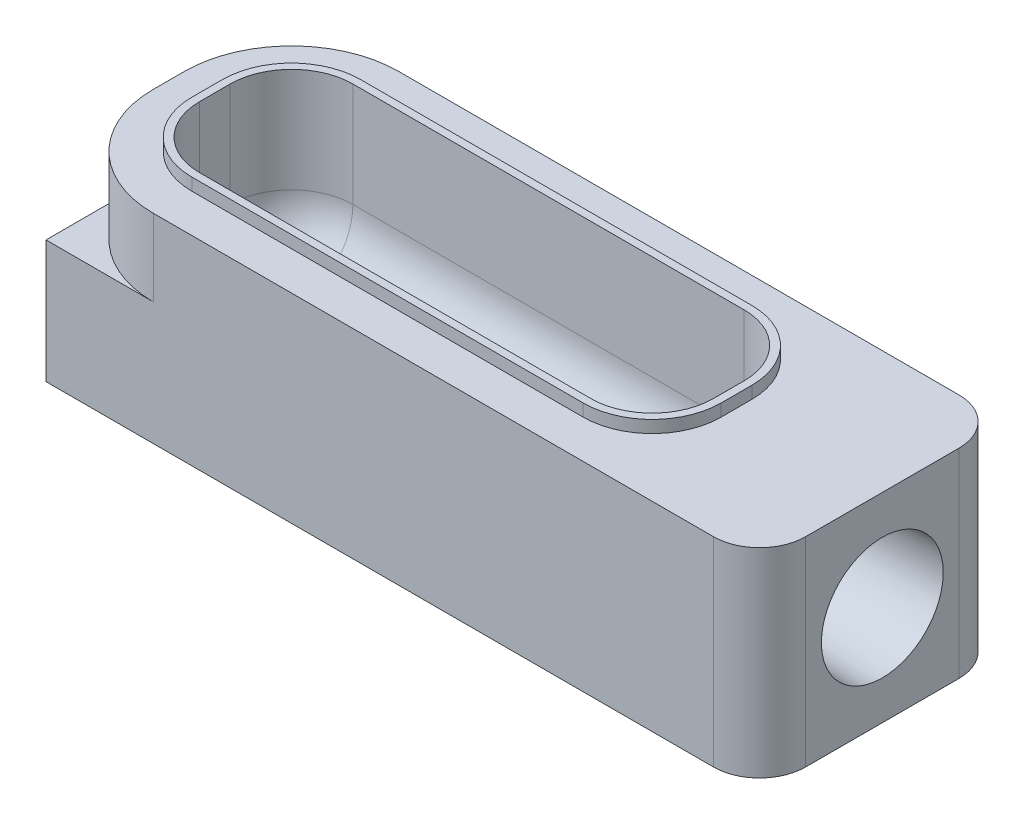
ISO-10303-21;
HEADER;
FILE_DESCRIPTION(('STEP AP214'),'2;1');
FILE_NAME('part.step','',(''),(''),'','','');
FILE_SCHEMA(('AUTOMOTIVE_DESIGN { 1 0 10303 214 1 1 1 1 }'));
ENDSEC;
DATA;
#1=APPLICATION_CONTEXT('core data for automotive mechanical design processes');
#2=APPLICATION_PROTOCOL_DEFINITION('international standard','automotive_design',2000,#1);
#3=PRODUCT_CONTEXT('',#1,'mechanical');
#4=PRODUCT('Part','Part','',(#3));
#5=PRODUCT_RELATED_PRODUCT_CATEGORY('part','',(#4));
#6=PRODUCT_DEFINITION_FORMATION('','',#4);
#7=PRODUCT_DEFINITION_CONTEXT('part definition',#1,'design');
#8=PRODUCT_DEFINITION('design','',#6,#7);
#9=PRODUCT_DEFINITION_SHAPE('','',#8);
#10=(LENGTH_UNIT() NAMED_UNIT(*) SI_UNIT(.MILLI.,.METRE.));
#11=(NAMED_UNIT(*) PLANE_ANGLE_UNIT() SI_UNIT($,.RADIAN.));
#12=(NAMED_UNIT(*) SI_UNIT($,.STERADIAN.) SOLID_ANGLE_UNIT());
#13=UNCERTAINTY_MEASURE_WITH_UNIT(LENGTH_MEASURE(1.E-05),#10,'distance_accuracy_value','');
#14=(GEOMETRIC_REPRESENTATION_CONTEXT(3) GLOBAL_UNCERTAINTY_ASSIGNED_CONTEXT((#13)) GLOBAL_UNIT_ASSIGNED_CONTEXT((#10,
#11,#12)) REPRESENTATION_CONTEXT('',''));
#15=CARTESIAN_POINT('',(0.,0.,0.));
#16=DIRECTION('',(0.,0.,1.));
#17=DIRECTION('',(1.,0.,0.));
#18=AXIS2_PLACEMENT_3D('',#15,#16,#17);
#19=CARTESIAN_POINT('',(0.,13.,0.));
#20=DIRECTION('',(0.,-1.,0.));
#21=DIRECTION('',(0.,0.,-1.));
#22=AXIS2_PLACEMENT_3D('',#19,#20,#21);
#23=PLANE('',#22);
#24=DIRECTION('',(0.,0.,-1.));
#25=VECTOR('',#24,1.);
#26=CARTESIAN_POINT('',(13.5,13.,37.));
#27=LINE('',#26,#25);
#28=CARTESIAN_POINT('',(13.5,13.,50.));
#29=VERTEX_POINT('',#28);
#30=CARTESIAN_POINT('',(13.5,13.,40.));
#31=VERTEX_POINT('',#30);
#32=EDGE_CURVE('E442',#29,#31,#27,.T.);
#33=ORIENTED_EDGE('',*,*,#32,.T.);
#34=CARTESIAN_POINT('',(10.5,13.,40.));
#35=DIRECTION('',(0.,-1.,0.));
#36=DIRECTION('',(0.,0.,-1.));
#37=AXIS2_PLACEMENT_3D('',#34,#35,#36);
#38=CIRCLE('',#37,3.);
#39=CARTESIAN_POINT('',(10.5,13.,37.));
#40=VERTEX_POINT('',#39);
#41=EDGE_CURVE('E52',#31,#40,#38,.F.);
#42=ORIENTED_EDGE('',*,*,#41,.T.);
#43=DIRECTION('',(-1.,0.,0.));
#44=VECTOR('',#43,1.);
#45=CARTESIAN_POINT('',(-33.,13.,37.));
#46=LINE('',#45,#44);
#47=CARTESIAN_POINT('',(-26.,13.,37.));
#48=VERTEX_POINT('',#47);
#49=EDGE_CURVE('E439',#40,#48,#46,.T.);
#50=ORIENTED_EDGE('',*,*,#49,.T.);
#51=CARTESIAN_POINT('',(-26.,13.,44.));
#52=DIRECTION('',(0.,-1.,0.));
#53=DIRECTION('',(0.,0.,-1.));
#54=AXIS2_PLACEMENT_3D('',#51,#52,#53);
#55=CIRCLE('',#54,7.);
#56=CARTESIAN_POINT('',(-33.,13.,44.));
#57=VERTEX_POINT('',#56);
#58=EDGE_CURVE('E391',#57,#48,#55,.T.);
#59=ORIENTED_EDGE('',*,*,#58,.F.);
#60=DIRECTION('',(0.,0.,1.));
#61=VECTOR('',#60,1.);
#62=CARTESIAN_POINT('',(-33.,13.,37.));
#63=LINE('',#62,#61);
#64=CARTESIAN_POINT('',(-33.,13.,46.));
#65=VERTEX_POINT('',#64);
#66=EDGE_CURVE('E435',#57,#65,#63,.T.);
#67=ORIENTED_EDGE('',*,*,#66,.T.);
#68=CARTESIAN_POINT('',(-26.,13.,46.));
#69=DIRECTION('',(0.,-1.,0.));
#70=DIRECTION('',(0.,0.,-1.));
#71=AXIS2_PLACEMENT_3D('',#68,#69,#70);
#72=CIRCLE('',#71,7.);
#73=CARTESIAN_POINT('',(-26.,13.,53.));
#74=VERTEX_POINT('',#73);
#75=EDGE_CURVE('E406',#74,#65,#72,.T.);
#76=ORIENTED_EDGE('',*,*,#75,.F.);
#77=DIRECTION('',(1.,0.,0.));
#78=VECTOR('',#77,1.);
#79=CARTESIAN_POINT('',(-33.,13.,53.));
#80=LINE('',#79,#78);
#81=CARTESIAN_POINT('',(10.5,13.,53.));
#82=VERTEX_POINT('',#81);
#83=EDGE_CURVE('E445',#74,#82,#80,.T.);
#84=ORIENTED_EDGE('',*,*,#83,.T.);
#85=CARTESIAN_POINT('',(10.5,13.,50.));
#86=DIRECTION('',(0.,-1.,0.));
#87=DIRECTION('',(0.,0.,-1.));
#88=AXIS2_PLACEMENT_3D('',#85,#86,#87);
#89=CIRCLE('',#88,3.);
#90=EDGE_CURVE('E776',#82,#29,#89,.F.);
#91=ORIENTED_EDGE('',*,*,#90,.T.);
#92=EDGE_LOOP('',(#33,#42,#50,#59,#67,#76,#84,#91));
#93=FACE_BOUND('',#92,.T.);
#94=DIRECTION('',(-1.,0.,0.));
#95=VECTOR('',#94,1.);
#96=CARTESIAN_POINT('',(0.,13.,39.5));
#97=LINE('',#96,#95);
#98=CARTESIAN_POINT('',(-0.499999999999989,13.,39.5));
#99=VERTEX_POINT('',#98);
#100=CARTESIAN_POINT('',(-26.,13.,39.5));
#101=VERTEX_POINT('',#100);
#102=EDGE_CURVE('E317',#99,#101,#97,.T.);
#103=ORIENTED_EDGE('',*,*,#102,.F.);
#104=CARTESIAN_POINT('',(-0.499999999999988,13.,44.));
#105=DIRECTION('',(0.,1.,0.));
#106=DIRECTION('',(0.,0.,1.));
#107=AXIS2_PLACEMENT_3D('',#104,#105,#106);
#108=CIRCLE('',#107,4.5);
#109=CARTESIAN_POINT('',(4.00000000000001,13.,44.));
#110=VERTEX_POINT('',#109);
#111=EDGE_CURVE('E280',#110,#99,#108,.T.);
#112=ORIENTED_EDGE('',*,*,#111,.F.);
#113=DIRECTION('',(0.,0.,-1.));
#114=VECTOR('',#113,1.);
#115=CARTESIAN_POINT('',(4.00000000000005,13.,0.));
#116=LINE('',#115,#114);
#117=CARTESIAN_POINT('',(4.00000000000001,13.,46.));
#118=VERTEX_POINT('',#117);
#119=EDGE_CURVE('E283',#118,#110,#116,.T.);
#120=ORIENTED_EDGE('',*,*,#119,.F.);
#121=CARTESIAN_POINT('',(-0.499999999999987,13.,46.));
#122=DIRECTION('',(0.,1.,0.));
#123=DIRECTION('',(0.,0.,1.));
#124=AXIS2_PLACEMENT_3D('',#121,#122,#123);
#125=CIRCLE('',#124,4.5);
#126=CARTESIAN_POINT('',(-0.499999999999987,13.,50.5));
#127=VERTEX_POINT('',#126);
#128=EDGE_CURVE('E328',#127,#118,#125,.T.);
#129=ORIENTED_EDGE('',*,*,#128,.F.);
#130=DIRECTION('',(1.,0.,0.));
#131=VECTOR('',#130,1.);
#132=CARTESIAN_POINT('',(0.,13.,50.5));
#133=LINE('',#132,#131);
#134=CARTESIAN_POINT('',(-26.,13.,50.5));
#135=VERTEX_POINT('',#134);
#136=EDGE_CURVE('E325',#135,#127,#133,.T.);
#137=ORIENTED_EDGE('',*,*,#136,.F.);
#138=CARTESIAN_POINT('',(-26.,13.,46.));
#139=DIRECTION('',(0.,1.,0.));
#140=DIRECTION('',(0.,0.,1.));
#141=AXIS2_PLACEMENT_3D('',#138,#139,#140);
#142=CIRCLE('',#141,4.5);
#143=CARTESIAN_POINT('',(-30.5,13.,46.));
#144=VERTEX_POINT('',#143);
#145=EDGE_CURVE('E322',#144,#135,#142,.T.);
#146=ORIENTED_EDGE('',*,*,#145,.F.);
#147=DIRECTION('',(0.,0.,1.));
#148=VECTOR('',#147,1.);
#149=CARTESIAN_POINT('',(-30.4999999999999,13.,0.));
#150=LINE('',#149,#148);
#151=CARTESIAN_POINT('',(-30.5,13.,44.));
#152=VERTEX_POINT('',#151);
#153=EDGE_CURVE('E64',#152,#144,#150,.T.);
#154=ORIENTED_EDGE('',*,*,#153,.F.);
#155=CARTESIAN_POINT('',(-26.,13.,44.));
#156=DIRECTION('',(0.,1.,0.));
#157=DIRECTION('',(0.,0.,1.));
#158=AXIS2_PLACEMENT_3D('',#155,#156,#157);
#159=CIRCLE('',#158,4.5);
#160=EDGE_CURVE('E59',#101,#152,#159,.T.);
#161=ORIENTED_EDGE('',*,*,#160,.F.);
#162=EDGE_LOOP('',(#103,#112,#120,#129,#137,#146,#154,#161));
#163=FACE_BOUND('',#162,.T.);
#164=ADVANCED_FACE('F44',(#93,#163),#23,.F.);
#165=CARTESIAN_POINT('',(-33.,28.,37.));
#166=DIRECTION('',(-1.,0.,0.));
#167=DIRECTION('',(0.,0.,1.));
#168=AXIS2_PLACEMENT_3D('',#165,#166,#167);
#169=PLANE('',#168);
#170=DIRECTION('',(0.,1.,0.));
#171=VECTOR('',#170,1.);
#172=CARTESIAN_POINT('',(-33.,8.,44.));
#173=LINE('',#172,#171);
#174=CARTESIAN_POINT('',(-33.,8.,44.));
#175=VERTEX_POINT('',#174);
#176=EDGE_CURVE('E389',#175,#57,#173,.T.);
#177=ORIENTED_EDGE('',*,*,#176,.F.);
#178=DIRECTION('',(0.,0.,1.));
#179=VECTOR('',#178,1.);
#180=CARTESIAN_POINT('',(-33.,8.,0.));
#181=LINE('',#180,#179);
#182=CARTESIAN_POINT('',(-33.,8.,37.));
#183=VERTEX_POINT('',#182);
#184=EDGE_CURVE('E385',#183,#175,#181,.T.);
#185=ORIENTED_EDGE('',*,*,#184,.F.);
#186=DIRECTION('',(0.,-1.,0.));
#187=VECTOR('',#186,1.);
#188=CARTESIAN_POINT('',(-33.,28.,37.));
#189=LINE('',#188,#187);
#190=CARTESIAN_POINT('',(-33.,0.,37.));
#191=VERTEX_POINT('',#190);
#192=EDGE_CURVE('E431',#183,#191,#189,.T.);
#193=ORIENTED_EDGE('',*,*,#192,.T.);
#194=DIRECTION('',(0.,0.,-1.));
#195=VECTOR('',#194,1.);
#196=CARTESIAN_POINT('',(-33.,0.,37.));
#197=LINE('',#196,#195);
#198=CARTESIAN_POINT('',(-33.,0.,53.));
#199=VERTEX_POINT('',#198);
#200=EDGE_CURVE('E420',#199,#191,#197,.T.);
#201=ORIENTED_EDGE('',*,*,#200,.F.);
#202=DIRECTION('',(0.,-1.,0.));
#203=VECTOR('',#202,1.);
#204=CARTESIAN_POINT('',(-33.,28.,53.));
#205=LINE('',#204,#203);
#206=CARTESIAN_POINT('',(-33.,8.,53.));
#207=VERTEX_POINT('',#206);
#208=EDGE_CURVE('E432',#207,#199,#205,.T.);
#209=ORIENTED_EDGE('',*,*,#208,.F.);
#210=DIRECTION('',(0.,0.,1.));
#211=VECTOR('',#210,1.);
#212=CARTESIAN_POINT('',(-33.,8.,0.));
#213=LINE('',#212,#211);
#214=CARTESIAN_POINT('',(-33.,8.,46.));
#215=VERTEX_POINT('',#214);
#216=EDGE_CURVE('E395',#215,#207,#213,.T.);
#217=ORIENTED_EDGE('',*,*,#216,.F.);
#218=DIRECTION('',(0.,1.,0.));
#219=VECTOR('',#218,1.);
#220=CARTESIAN_POINT('',(-33.,8.,46.));
#221=LINE('',#220,#219);
#222=EDGE_CURVE('E400',#215,#65,#221,.T.);
#223=ORIENTED_EDGE('',*,*,#222,.T.);
#224=ORIENTED_EDGE('',*,*,#66,.F.);
#225=EDGE_LOOP('',(#177,#185,#193,#201,#209,#217,#223,#224));
#226=FACE_BOUND('',#225,.T.);
#227=ADVANCED_FACE('F583',(#226),#169,.T.);
#228=CARTESIAN_POINT('',(-33.,28.,37.));
#229=DIRECTION('',(0.,0.,-1.));
#230=DIRECTION('',(-1.,0.,0.));
#231=AXIS2_PLACEMENT_3D('',#228,#229,#230);
#232=PLANE('',#231);
#233=ORIENTED_EDGE('',*,*,#49,.F.);
#234=DIRECTION('',(0.,-1.,0.));
#235=VECTOR('',#234,1.);
#236=CARTESIAN_POINT('',(10.5,28.,37.));
#237=LINE('',#236,#235);
#238=CARTESIAN_POINT('',(10.5,0.,37.));
#239=VERTEX_POINT('',#238);
#240=EDGE_CURVE('E758',#40,#239,#237,.T.);
#241=ORIENTED_EDGE('',*,*,#240,.T.);
#242=DIRECTION('',(1.,0.,0.));
#243=VECTOR('',#242,1.);
#244=CARTESIAN_POINT('',(-33.,0.,37.));
#245=LINE('',#244,#243);
#246=EDGE_CURVE('E423',#191,#239,#245,.T.);
#247=ORIENTED_EDGE('',*,*,#246,.F.);
#248=ORIENTED_EDGE('',*,*,#192,.F.);
#249=DIRECTION('',(-1.,0.,0.));
#250=VECTOR('',#249,1.);
#251=CARTESIAN_POINT('',(0.,8.,37.));
#252=LINE('',#251,#250);
#253=CARTESIAN_POINT('',(-26.,8.,37.));
#254=VERTEX_POINT('',#253);
#255=EDGE_CURVE('E382',#254,#183,#252,.T.);
#256=ORIENTED_EDGE('',*,*,#255,.F.);
#257=DIRECTION('',(0.,1.,0.));
#258=VECTOR('',#257,1.);
#259=CARTESIAN_POINT('',(-26.,8.,37.));
#260=LINE('',#259,#258);
#261=EDGE_CURVE('E388',#254,#48,#260,.T.);
#262=ORIENTED_EDGE('',*,*,#261,.T.);
#263=EDGE_LOOP('',(#233,#241,#247,#248,#256,#262));
#264=FACE_BOUND('',#263,.T.);
#265=ADVANCED_FACE('F588',(#264),#232,.T.);
#266=CARTESIAN_POINT('',(-30.,28.,37.));
#267=DIRECTION('',(-1.,0.,0.));
#268=DIRECTION('',(0.,0.,1.));
#269=AXIS2_PLACEMENT_3D('',#266,#267,#268);
#270=PLANE('',#269);
#271=DIRECTION('',(0.,0.,-1.));
#272=VECTOR('',#271,1.);
#273=CARTESIAN_POINT('',(-30.,7.,37.));
#274=LINE('',#273,#272);
#275=CARTESIAN_POINT('',(-30.,7.,46.));
#276=VERTEX_POINT('',#275);
#277=CARTESIAN_POINT('',(-30.,7.,44.));
#278=VERTEX_POINT('',#277);
#279=EDGE_CURVE('E261',#276,#278,#274,.T.);
#280=ORIENTED_EDGE('',*,*,#279,.T.);
#281=DIRECTION('',(0.,-1.,0.));
#282=VECTOR('',#281,1.);
#283=CARTESIAN_POINT('',(-30.,13.,44.));
#284=LINE('',#283,#282);
#285=CARTESIAN_POINT('',(-30.,13.8,44.));
#286=VERTEX_POINT('',#285);
#287=EDGE_CURVE('E511',#278,#286,#284,.F.);
#288=ORIENTED_EDGE('',*,*,#287,.T.);
#289=DIRECTION('',(0.,0.,-1.));
#290=VECTOR('',#289,1.);
#291=CARTESIAN_POINT('',(-30.,13.8,0.));
#292=LINE('',#291,#290);
#293=CARTESIAN_POINT('',(-30.,13.8,46.));
#294=VERTEX_POINT('',#293);
#295=EDGE_CURVE('E279',#294,#286,#292,.T.);
#296=ORIENTED_EDGE('',*,*,#295,.F.);
#297=DIRECTION('',(0.,-1.,0.));
#298=VECTOR('',#297,1.);
#299=CARTESIAN_POINT('',(-30.,3.,46.));
#300=LINE('',#299,#298);
#301=EDGE_CURVE('E509',#294,#276,#300,.T.);
#302=ORIENTED_EDGE('',*,*,#301,.T.);
#303=EDGE_LOOP('',(#280,#288,#296,#302));
#304=FACE_BOUND('',#303,.T.);
#305=ADVANCED_FACE('F707',(#304),#270,.F.);
#306=CARTESIAN_POINT('',(-33.,28.,50.));
#307=DIRECTION('',(0.,0.,1.));
#308=DIRECTION('',(1.,0.,0.));
#309=AXIS2_PLACEMENT_3D('',#306,#307,#308);
#310=PLANE('',#309);
#311=DIRECTION('',(-1.,0.,0.));
#312=VECTOR('',#311,1.);
#313=CARTESIAN_POINT('',(-33.,7.,50.));
#314=LINE('',#313,#312);
#315=CARTESIAN_POINT('',(-0.499999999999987,7.,50.));
#316=VERTEX_POINT('',#315);
#317=CARTESIAN_POINT('',(-26.,7.,50.));
#318=VERTEX_POINT('',#317);
#319=EDGE_CURVE('E513',#316,#318,#314,.T.);
#320=ORIENTED_EDGE('',*,*,#319,.T.);
#321=DIRECTION('',(0.,-1.,0.));
#322=VECTOR('',#321,1.);
#323=CARTESIAN_POINT('',(-26.,13.,50.));
#324=LINE('',#323,#322);
#325=CARTESIAN_POINT('',(-26.,13.8,50.));
#326=VERTEX_POINT('',#325);
#327=EDGE_CURVE('E515',#318,#326,#324,.F.);
#328=ORIENTED_EDGE('',*,*,#327,.T.);
#329=DIRECTION('',(-1.,0.,0.));
#330=VECTOR('',#329,1.);
#331=CARTESIAN_POINT('',(0.,13.8,50.));
#332=LINE('',#331,#330);
#333=CARTESIAN_POINT('',(-0.499999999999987,13.8,50.));
#334=VERTEX_POINT('',#333);
#335=EDGE_CURVE('E293',#334,#326,#332,.T.);
#336=ORIENTED_EDGE('',*,*,#335,.F.);
#337=DIRECTION('',(0.,-1.,0.));
#338=VECTOR('',#337,1.);
#339=CARTESIAN_POINT('',(-0.499999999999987,3.,50.));
#340=LINE('',#339,#338);
#341=EDGE_CURVE('E457',#334,#316,#340,.T.);
#342=ORIENTED_EDGE('',*,*,#341,.T.);
#343=EDGE_LOOP('',(#320,#328,#336,#342));
#344=FACE_BOUND('',#343,.T.);
#345=ADVANCED_FACE('F712',(#344),#310,.F.);
#346=CARTESIAN_POINT('',(3.50000000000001,28.,37.));
#347=DIRECTION('',(1.,0.,0.));
#348=DIRECTION('',(0.,0.,-1.));
#349=AXIS2_PLACEMENT_3D('',#346,#347,#348);
#350=PLANE('',#349);
#351=DIRECTION('',(0.,-1.,0.));
#352=VECTOR('',#351,1.);
#353=CARTESIAN_POINT('',(3.50000000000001,13.,46.));
#354=LINE('',#353,#352);
#355=CARTESIAN_POINT('',(3.50000000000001,9.40616371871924,46.));
#356=VERTEX_POINT('',#355);
#357=CARTESIAN_POINT('',(3.50000000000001,13.8,46.));
#358=VERTEX_POINT('',#357);
#359=EDGE_CURVE('E452',#356,#358,#354,.F.);
#360=ORIENTED_EDGE('',*,*,#359,.T.);
#361=DIRECTION('',(0.,0.,1.));
#362=VECTOR('',#361,1.);
#363=CARTESIAN_POINT('',(3.50000000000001,13.8,0.));
#364=LINE('',#363,#362);
#365=CARTESIAN_POINT('',(3.50000000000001,13.8,44.));
#366=VERTEX_POINT('',#365);
#367=EDGE_CURVE('E287',#366,#358,#364,.T.);
#368=ORIENTED_EDGE('',*,*,#367,.F.);
#369=DIRECTION('',(0.,-1.,0.));
#370=VECTOR('',#369,1.);
#371=CARTESIAN_POINT('',(3.50000000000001,3.,44.));
#372=LINE('',#371,#370);
#373=CARTESIAN_POINT('',(3.50000000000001,9.40616371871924,44.));
#374=VERTEX_POINT('',#373);
#375=EDGE_CURVE('E454',#366,#374,#372,.T.);
#376=ORIENTED_EDGE('',*,*,#375,.T.);
#377=CARTESIAN_POINT('',(3.50000000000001,6.5,45.));
#378=DIRECTION('',(1.,0.,0.));
#379=DIRECTION('',(0.,0.,-1.));
#380=AXIS2_PLACEMENT_3D('',#377,#378,#379);
#381=CIRCLE('',#380,3.0734);
#382=EDGE_CURVE('E419',#374,#356,#381,.T.);
#383=ORIENTED_EDGE('',*,*,#382,.T.);
#384=EDGE_LOOP('',(#360,#368,#376,#383));
#385=FACE_BOUND('',#384,.T.);
#386=ADVANCED_FACE('F716',(#385),#350,.F.);
#387=CARTESIAN_POINT('',(-33.,28.,40.));
#388=DIRECTION('',(0.,0.,-1.));
#389=DIRECTION('',(-1.,0.,0.));
#390=AXIS2_PLACEMENT_3D('',#387,#388,#389);
#391=PLANE('',#390);
#392=DIRECTION('',(0.,-1.,0.));
#393=VECTOR('',#392,1.);
#394=CARTESIAN_POINT('',(-0.499999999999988,13.,40.));
#395=LINE('',#394,#393);
#396=CARTESIAN_POINT('',(-0.499999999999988,7.,40.));
#397=VERTEX_POINT('',#396);
#398=CARTESIAN_POINT('',(-0.499999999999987,13.8,40.));
#399=VERTEX_POINT('',#398);
#400=EDGE_CURVE('E268',#397,#399,#395,.F.);
#401=ORIENTED_EDGE('',*,*,#400,.T.);
#402=DIRECTION('',(1.,0.,0.));
#403=VECTOR('',#402,1.);
#404=CARTESIAN_POINT('',(0.,13.8,40.));
#405=LINE('',#404,#403);
#406=CARTESIAN_POINT('',(-26.,13.8,40.));
#407=VERTEX_POINT('',#406);
#408=EDGE_CURVE('E265',#407,#399,#405,.T.);
#409=ORIENTED_EDGE('',*,*,#408,.F.);
#410=DIRECTION('',(0.,-1.,0.));
#411=VECTOR('',#410,1.);
#412=CARTESIAN_POINT('',(-26.,3.,40.));
#413=LINE('',#412,#411);
#414=CARTESIAN_POINT('',(-26.,7.,40.));
#415=VERTEX_POINT('',#414);
#416=EDGE_CURVE('E250',#407,#415,#413,.T.);
#417=ORIENTED_EDGE('',*,*,#416,.T.);
#418=DIRECTION('',(1.,0.,0.));
#419=VECTOR('',#418,1.);
#420=CARTESIAN_POINT('',(-33.,7.,40.));
#421=LINE('',#420,#419);
#422=EDGE_CURVE('E262',#415,#397,#421,.T.);
#423=ORIENTED_EDGE('',*,*,#422,.T.);
#424=EDGE_LOOP('',(#401,#409,#417,#423));
#425=FACE_BOUND('',#424,.T.);
#426=ADVANCED_FACE('F266',(#425),#391,.F.);
#427=CARTESIAN_POINT('',(0.,3.,0.));
#428=DIRECTION('',(0.,1.,0.));
#429=DIRECTION('',(0.,0.,1.));
#430=AXIS2_PLACEMENT_3D('',#427,#428,#429);
#431=PLANE('',#430);
#432=DIRECTION('',(0.,0.,-1.));
#433=VECTOR('',#432,1.);
#434=CARTESIAN_POINT('',(-26.,3.,0.));
#435=LINE('',#434,#433);
#436=CARTESIAN_POINT('',(-26.,3.,44.));
#437=VERTEX_POINT('',#436);
#438=CARTESIAN_POINT('',(-26.,3.,46.));
#439=VERTEX_POINT('',#438);
#440=EDGE_CURVE('E519',#437,#439,#435,.F.);
#441=ORIENTED_EDGE('',*,*,#440,.T.);
#442=DIRECTION('',(-1.,0.,0.));
#443=VECTOR('',#442,1.);
#444=CARTESIAN_POINT('',(0.,3.,46.));
#445=LINE('',#444,#443);
#446=CARTESIAN_POINT('',(-0.499999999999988,3.,46.));
#447=VERTEX_POINT('',#446);
#448=EDGE_CURVE('E521',#439,#447,#445,.F.);
#449=ORIENTED_EDGE('',*,*,#448,.T.);
#450=DIRECTION('',(0.,0.,1.));
#451=VECTOR('',#450,1.);
#452=CARTESIAN_POINT('',(-0.499999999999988,3.,0.));
#453=LINE('',#452,#451);
#454=CARTESIAN_POINT('',(-0.499999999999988,3.,44.));
#455=VERTEX_POINT('',#454);
#456=EDGE_CURVE('E441',#447,#455,#453,.F.);
#457=ORIENTED_EDGE('',*,*,#456,.T.);
#458=DIRECTION('',(1.,0.,0.));
#459=VECTOR('',#458,1.);
#460=CARTESIAN_POINT('',(0.,3.,44.));
#461=LINE('',#460,#459);
#462=EDGE_CURVE('E517',#455,#437,#461,.F.);
#463=ORIENTED_EDGE('',*,*,#462,.T.);
#464=EDGE_LOOP('',(#441,#449,#457,#463));
#465=FACE_BOUND('',#464,.T.);
#466=ADVANCED_FACE('F684',(#465),#431,.T.);
#467=CARTESIAN_POINT('',(13.5,6.5,45.));
#468=DIRECTION('',(1.,0.,0.));
#469=DIRECTION('',(0.,0.,-1.));
#470=AXIS2_PLACEMENT_3D('',#467,#468,#469);
#471=CYLINDRICAL_SURFACE('',#470,3.0734);
#472=CARTESIAN_POINT('',(6.61000000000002,6.5,45.));
#473=DIRECTION('',(1.,0.,0.));
#474=DIRECTION('',(0.,0.,-1.));
#475=AXIS2_PLACEMENT_3D('',#472,#473,#474);
#476=CIRCLE('',#475,3.07340000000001);
#477=CARTESIAN_POINT('',(6.61000000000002,6.5,41.9266));
#478=VERTEX_POINT('',#477);
#479=EDGE_CURVE('E416',#478,#478,#476,.T.);
#480=ORIENTED_EDGE('',*,*,#479,.T.);
#481=EDGE_LOOP('',(#480));
#482=FACE_BOUND('',#481,.T.);
#483=ORIENTED_EDGE('',*,*,#382,.F.);
#484=CARTESIAN_POINT('',(3.50000000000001,9.40616371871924,44.));
#485=CARTESIAN_POINT('',(3.50001429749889,9.37982573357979,43.9234102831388));
#486=CARTESIAN_POINT('',(3.49780089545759,9.3504422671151,43.8479018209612));
#487=CARTESIAN_POINT('',(3.48939662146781,9.2859421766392,43.6996869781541));
#488=CARTESIAN_POINT('',(3.48320964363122,9.25083119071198,43.6269779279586));
#489=CARTESIAN_POINT('',(3.46738591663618,9.17542692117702,43.4853113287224));
#490=CARTESIAN_POINT('',(3.45777185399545,9.13516880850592,43.416332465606));
#491=CARTESIAN_POINT('',(3.43562882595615,9.04965785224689,43.2820432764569));
#492=CARTESIAN_POINT('',(3.42309920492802,9.0044038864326,43.2167337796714));
#493=CARTESIAN_POINT('',(3.38207415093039,8.86202412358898,43.0273153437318));
#494=CARTESIAN_POINT('',(3.3500634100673,8.75794369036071,42.9090889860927));
#495=CARTESIAN_POINT('',(3.28127233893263,8.53369625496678,42.6903454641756));
#496=CARTESIAN_POINT('',(3.24448165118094,8.41349430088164,42.5898679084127));
#497=CARTESIAN_POINT('',(3.1672571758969,8.14643681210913,42.3991154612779));
#498=CARTESIAN_POINT('',(3.12682869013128,7.99811677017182,42.3108794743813));
#499=CARTESIAN_POINT('',(3.05266570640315,7.68734643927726,42.1599761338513));
#500=CARTESIAN_POINT('',(3.01892689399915,7.5249053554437,42.0972922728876));
#501=CARTESIAN_POINT('',(2.97813874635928,7.27378181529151,42.024320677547));
#502=CARTESIAN_POINT('',(2.96618038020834,7.18884294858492,42.0035073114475));
#503=CARTESIAN_POINT('',(2.94616179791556,7.01707403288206,41.9691454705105));
#504=CARTESIAN_POINT('',(2.93809950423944,6.9302450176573,41.9555931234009));
#505=CARTESIAN_POINT('',(2.92636036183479,6.75549733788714,41.9359776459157));
#506=CARTESIAN_POINT('',(2.92268094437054,6.66757934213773,41.929910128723));
#507=CARTESIAN_POINT('',(2.91991517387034,6.49150446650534,41.9253488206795));
#508=CARTESIAN_POINT('',(2.92082809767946,6.40334762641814,41.9268538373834));
#509=CARTESIAN_POINT('',(2.92954671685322,6.16398430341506,41.9412651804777));
#510=CARTESIAN_POINT('',(2.94186283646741,6.01332323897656,41.9616348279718));
#511=CARTESIAN_POINT('',(2.9779648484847,5.71810369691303,42.0238932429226));
#512=CARTESIAN_POINT('',(3.00174481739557,5.57354210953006,42.065770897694));
#513=CARTESIAN_POINT('',(3.03683938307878,5.39566151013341,42.1315740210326));
#514=CARTESIAN_POINT('',(3.04460883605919,5.35804908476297,42.1463413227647));
#515=CARTESIAN_POINT('',(3.06061366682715,5.28360540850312,42.177272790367));
#516=CARTESIAN_POINT('',(3.0688479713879,5.24677260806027,42.1934337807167));
#517=CARTESIAN_POINT('',(3.07728366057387,5.21029566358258,42.2102956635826));
#518=B_SPLINE_CURVE_WITH_KNOTS('',3,(#484,#485,#486,#487,#488,#489,#490,#491,#492,#493,#494,
#495,#496,#497,#498,#499,#500,#501,#502,#503,#504,#505,#506,#507,#508,#509,#510,#511,#512,#513,
#514,#515,#516,#517),.UNSPECIFIED.,.F.,.F.,(4,2,2,2,2,2,2,2,2,2,2,2,2,2,2,2,4),(0.,
0.242833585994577,0.485429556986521,0.72644854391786,0.967521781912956,1.44754504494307,
1.92862636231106,2.45803559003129,2.98710226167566,3.25156025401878,3.51587707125,
3.78003890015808,4.04415913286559,4.499435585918,4.95447704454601,5.07790089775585,
5.20105060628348),.UNSPECIFIED.);
#519=CARTESIAN_POINT('',(2.94515947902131,7.,41.9675443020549));
#520=VERTEX_POINT('',#519);
#521=EDGE_CURVE('E468',#374,#520,#518,.T.);
#522=ORIENTED_EDGE('',*,*,#521,.T.);
#523=CARTESIAN_POINT('',(2.94515947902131,7.,41.9675443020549));
#524=CARTESIAN_POINT('',(2.93699562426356,6.91606034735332,41.9536933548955));
#525=CARTESIAN_POINT('',(2.92771627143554,6.83165695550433,41.9433672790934));
#526=CARTESIAN_POINT('',(2.90696750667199,6.6625718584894,41.9297339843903));
#527=CARTESIAN_POINT('',(2.89549859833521,6.57789022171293,41.9264251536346));
#528=CARTESIAN_POINT('',(2.87043855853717,6.40906537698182,41.9267886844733));
#529=CARTESIAN_POINT('',(2.85685268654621,6.32492135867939,41.9304439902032));
#530=CARTESIAN_POINT('',(2.82759184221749,6.15759603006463,41.9445774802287));
#531=CARTESIAN_POINT('',(2.8119168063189,6.07441474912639,41.955055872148));
#532=CARTESIAN_POINT('',(2.76184073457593,5.82726562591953,41.9964949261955));
#533=CARTESIAN_POINT('',(2.72435690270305,5.66547657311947,42.0374605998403));
#534=CARTESIAN_POINT('',(2.64168784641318,5.35243892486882,42.1440781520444));
#535=CARTESIAN_POINT('',(2.59650059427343,5.20119311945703,42.2097365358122));
#536=CARTESIAN_POINT('',(2.49738723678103,4.90843200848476,42.3654217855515));
#537=CARTESIAN_POINT('',(2.44323537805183,4.7673581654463,42.4561350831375));
#538=CARTESIAN_POINT('',(2.32773970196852,4.50351801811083,42.6574771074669));
#539=CARTESIAN_POINT('',(2.26639221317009,4.38076113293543,42.7681160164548));
#540=CARTESIAN_POINT('',(2.13315820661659,4.14942329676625,43.0124061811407));
#541=CARTESIAN_POINT('',(2.06086304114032,4.04210948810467,43.1470312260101));
#542=CARTESIAN_POINT('',(1.90919305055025,3.85283677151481,43.4292899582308));
#543=CARTESIAN_POINT('',(1.82982521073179,3.7708531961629,43.5769108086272));
#544=CARTESIAN_POINT('',(1.7226813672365,3.68168389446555,43.7730903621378));
#545=CARTESIAN_POINT('',(1.69797347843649,3.66250853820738,43.8181300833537));
#546=CARTESIAN_POINT('',(1.64799725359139,3.62646189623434,43.9087021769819));
#547=CARTESIAN_POINT('',(1.62272996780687,3.60958665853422,43.954233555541));
#548=CARTESIAN_POINT('',(1.59715252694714,3.59383628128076,44.));
#549=B_SPLINE_CURVE_WITH_KNOTS('',3,(#523,#524,#525,#526,#527,#528,#529,#530,#531,#532,#533,
#534,#535,#536,#537,#538,#539,#540,#541,#542,#543,#544,#545,#546,#547,#548),.UNSPECIFIED.,.F.,
.F.,(4,2,2,2,2,2,2,2,2,2,2,2,4),(0.,0.25630172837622,0.512544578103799,0.768160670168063,
1.02378454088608,1.53438568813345,2.04512144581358,2.57154185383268,3.09823203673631,
3.6560602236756,4.21334345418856,4.37781076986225,4.54199184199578),.UNSPECIFIED.);
#550=CARTESIAN_POINT('',(1.59715252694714,3.59383628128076,44.));
#551=VERTEX_POINT('',#550);
#552=EDGE_CURVE('E528',#520,#551,#549,.T.);
#553=ORIENTED_EDGE('',*,*,#552,.T.);
#554=CARTESIAN_POINT('',(3.07728366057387,5.21029566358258,42.2102956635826));
#555=CARTESIAN_POINT('',(3.03322609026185,5.12221571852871,42.2510249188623));
#556=CARTESIAN_POINT('',(2.98661514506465,5.03719263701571,42.2953845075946));
#557=CARTESIAN_POINT('',(2.88926649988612,4.87352237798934,42.3905333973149));
#558=CARTESIAN_POINT('',(2.83853483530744,4.79486620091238,42.4413133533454));
#559=CARTESIAN_POINT('',(2.73391603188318,4.64411531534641,42.5484673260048));
#560=CARTESIAN_POINT('',(2.68003660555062,4.57200559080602,42.6048278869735));
#561=CARTESIAN_POINT('',(2.56984364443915,4.43409844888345,42.72270538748));
#562=CARTESIAN_POINT('',(2.51352924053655,4.36830331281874,42.7842241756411));
#563=CARTESIAN_POINT('',(2.39967719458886,4.24337691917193,42.9116150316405));
#564=CARTESIAN_POINT('',(2.34214904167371,4.18420766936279,42.9774584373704));
#565=CARTESIAN_POINT('',(2.2264142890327,4.07200416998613,43.1136255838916));
#566=CARTESIAN_POINT('',(2.16820765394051,4.01897024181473,43.1839495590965));
#567=CARTESIAN_POINT('',(2.05212590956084,3.91900720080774,43.3290635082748));
#568=CARTESIAN_POINT('',(1.99425078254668,3.87207775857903,43.4038532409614));
#569=CARTESIAN_POINT('',(1.88012509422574,3.78438538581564,43.5580940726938));
#570=CARTESIAN_POINT('',(1.82387380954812,3.74361967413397,43.6375430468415));
#571=CARTESIAN_POINT('',(1.71136406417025,3.66611228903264,43.8066624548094));
#572=CARTESIAN_POINT('',(1.65531748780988,3.62977171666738,43.8966609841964));
#573=CARTESIAN_POINT('',(1.55020193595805,3.56481820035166,44.0833479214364));
#574=CARTESIAN_POINT('',(1.50112755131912,3.53619925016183,44.1800310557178));
#575=CARTESIAN_POINT('',(1.42195846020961,3.49175255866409,44.3646089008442));
#576=CARTESIAN_POINT('',(1.39007747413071,3.47460431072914,44.4513937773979));
#577=CARTESIAN_POINT('',(1.33897217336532,3.4476708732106,44.6296874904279));
#578=CARTESIAN_POINT('',(1.3197129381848,3.43786535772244,44.7211825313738));
#579=CARTESIAN_POINT('',(1.30023822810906,3.42799386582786,44.8838712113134));
#580=CARTESIAN_POINT('',(1.29650737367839,3.42612735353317,44.9545321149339));
#581=CARTESIAN_POINT('',(1.2987915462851,3.42727725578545,45.0956210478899));
#582=CARTESIAN_POINT('',(1.30480309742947,3.430291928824,45.1660491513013));
#583=CARTESIAN_POINT('',(1.33258379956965,3.44443713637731,45.3498820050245));
#584=CARTESIAN_POINT('',(1.36199570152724,3.45953768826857,45.4618255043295));
#585=CARTESIAN_POINT('',(1.43748363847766,3.50029499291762,45.6781443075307));
#586=CARTESIAN_POINT('',(1.48366578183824,3.5260191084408,45.7824662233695));
#587=CARTESIAN_POINT('',(1.57617176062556,3.58066329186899,45.9646318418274));
#588=CARTESIAN_POINT('',(1.62086875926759,3.60809692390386,46.0437894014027));
#589=CARTESIAN_POINT('',(1.71428775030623,3.66833125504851,46.1976110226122));
#590=CARTESIAN_POINT('',(1.76301275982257,3.70113599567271,46.2722716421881));
#591=CARTESIAN_POINT('',(1.86278775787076,3.77184557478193,46.4175643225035));
#592=CARTESIAN_POINT('',(1.91383923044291,3.80975369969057,46.4881937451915));
#593=CARTESIAN_POINT('',(2.01705864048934,3.89054422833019,46.6256958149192));
#594=CARTESIAN_POINT('',(2.06922673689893,3.93342734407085,46.6925679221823));
#595=CARTESIAN_POINT('',(2.17879042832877,4.028496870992,46.8289374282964));
#596=CARTESIAN_POINT('',(2.23620786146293,4.08118101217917,46.8980722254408));
#597=CARTESIAN_POINT('',(2.35033228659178,4.19251396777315,47.0319648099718));
#598=CARTESIAN_POINT('',(2.4070391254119,4.25116404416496,47.0967216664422));
#599=CARTESIAN_POINT('',(2.57447203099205,4.43580641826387,47.2837481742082));
#600=CARTESIAN_POINT('',(2.68300781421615,4.57090839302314,47.3993769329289));
#601=CARTESIAN_POINT('',(2.83775929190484,4.79367279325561,47.5578992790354));
#602=CARTESIAN_POINT('',(2.88864268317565,4.87251109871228,47.6088456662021));
#603=CARTESIAN_POINT('',(2.98629617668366,5.03661910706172,47.7043147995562));
#604=CARTESIAN_POINT('',(3.03305830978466,5.12190070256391,47.7488252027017));
#605=CARTESIAN_POINT('',(3.07728366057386,5.21029566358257,47.7897043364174));
#606=B_SPLINE_CURVE_WITH_KNOTS('',3,(#554,#555,#556,#557,#558,#559,#560,#561,#562,#563,#564,
#565,#566,#567,#568,#569,#570,#571,#572,#573,#574,#575,#576,#577,#578,#579,#580,#581,#582,#583,
#584,#585,#586,#587,#588,#589,#590,#591,#592,#593,#594,#595,#596,#597,#598,#599,#600,#601,#602,
#603,#604,#605),.UNSPECIFIED.,.F.,.F.,(4,2,2,2,2,2,2,2,2,2,2,2,2,2,2,2,2,2,2,2,2,2,2,2,2,4),(0.,
0.319465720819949,0.638471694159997,0.956726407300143,1.27509566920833,1.59153423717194,
1.90798937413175,2.22442742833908,2.54072227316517,2.87644952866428,3.21191488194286,
3.49309135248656,3.77348657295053,3.98501857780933,4.19647512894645,4.54379511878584,
4.8933520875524,5.17783569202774,5.46253434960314,5.7474172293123,6.03234093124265,
6.34457085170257,6.65686695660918,7.27882297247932,7.5987369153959,7.91925648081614),.UNSPECIFIED.);
#607=CARTESIAN_POINT('',(1.59715252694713,3.59383628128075,46.));
#608=VERTEX_POINT('',#607);
#609=EDGE_CURVE('E460',#551,#608,#606,.T.);
#610=ORIENTED_EDGE('',*,*,#609,.T.);
#611=CARTESIAN_POINT('',(1.59715252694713,3.59383628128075,46.));
#612=CARTESIAN_POINT('',(1.64406229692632,3.62270716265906,46.08394734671));
#613=CARTESIAN_POINT('',(1.68996482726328,3.65541972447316,46.1671509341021));
#614=CARTESIAN_POINT('',(1.77976037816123,3.72845649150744,46.3313093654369));
#615=CARTESIAN_POINT('',(1.82365272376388,3.7687832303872,46.4122634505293));
#616=CARTESIAN_POINT('',(1.90952018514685,3.85707922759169,46.5713243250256));
#617=CARTESIAN_POINT('',(1.95148966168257,3.90506931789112,46.6494226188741));
#618=CARTESIAN_POINT('',(2.03333314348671,4.00841477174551,46.8017374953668));
#619=CARTESIAN_POINT('',(2.07320739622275,4.06376926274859,46.8759545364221));
#620=CARTESIAN_POINT('',(2.15089865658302,4.18171835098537,47.0199102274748));
#621=CARTESIAN_POINT('',(2.18871053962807,4.24432987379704,47.089637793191));
#622=CARTESIAN_POINT('',(2.26211266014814,4.37634920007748,47.223678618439));
#623=CARTESIAN_POINT('',(2.29770208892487,4.44575945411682,47.2879899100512));
#624=CARTESIAN_POINT('',(2.36650343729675,4.59078923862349,47.4103293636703));
#625=CARTESIAN_POINT('',(2.3997190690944,4.66639865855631,47.4683674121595));
#626=CARTESIAN_POINT('',(2.46374034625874,4.82337891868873,47.5775704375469));
#627=CARTESIAN_POINT('',(2.49454621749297,4.90474921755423,47.6287360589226));
#628=CARTESIAN_POINT('',(2.55179283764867,5.06734223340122,47.7205589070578));
#629=CARTESIAN_POINT('',(2.57838626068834,5.148252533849,47.7616745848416));
#630=CARTESIAN_POINT('',(2.62928043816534,5.31396001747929,47.8367881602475));
#631=CARTESIAN_POINT('',(2.65358225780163,5.39875536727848,47.8707893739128));
#632=CARTESIAN_POINT('',(2.69983192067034,5.57164197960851,47.9312674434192));
#633=CARTESIAN_POINT('',(2.72177904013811,5.6597342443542,47.9577419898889));
#634=CARTESIAN_POINT('',(2.76322192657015,5.83844085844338,48.0027674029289));
#635=CARTESIAN_POINT('',(2.7827189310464,5.92905390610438,48.0213222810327));
#636=CARTESIAN_POINT('',(2.81695784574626,6.1008360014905,48.048452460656));
#637=CARTESIAN_POINT('',(2.83198967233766,6.18179934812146,48.0579730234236));
#638=CARTESIAN_POINT('',(2.86007033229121,6.34455996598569,48.0705516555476));
#639=CARTESIAN_POINT('',(2.87311945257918,6.42635711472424,48.0736106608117));
#640=CARTESIAN_POINT('',(2.89720907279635,6.5903375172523,48.0731666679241));
#641=CARTESIAN_POINT('',(2.90824697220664,6.67252113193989,48.0696552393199));
#642=CARTESIAN_POINT('',(2.92826061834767,6.83661626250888,48.0560226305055));
#643=CARTESIAN_POINT('',(2.93723571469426,6.91852768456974,48.0458993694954));
#644=CARTESIAN_POINT('',(2.94515947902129,7.,48.0324556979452));
#645=B_SPLINE_CURVE_WITH_KNOTS('',3,(#611,#612,#613,#614,#615,#616,#617,#618,#619,#620,#621,
#622,#623,#624,#625,#626,#627,#628,#629,#630,#631,#632,#633,#634,#635,#636,#637,#638,#639,#640,
#641,#642,#643,#644),.UNSPECIFIED.,.F.,.F.,(4,2,2,2,2,2,2,2,2,2,2,2,2,2,2,2,4),(0.,
0.301153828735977,0.602408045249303,0.904495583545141,1.20654736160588,1.5093183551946,
1.81219888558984,2.11459490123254,2.4169625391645,2.70031829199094,2.98354167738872,
3.26685186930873,3.55001838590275,3.79843430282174,4.04681423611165,4.29551308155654,
4.54429023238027),.UNSPECIFIED.);
#646=CARTESIAN_POINT('',(2.9451594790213,7.,48.0324556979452));
#647=VERTEX_POINT('',#646);
#648=EDGE_CURVE('E523',#608,#647,#645,.T.);
#649=ORIENTED_EDGE('',*,*,#648,.T.);
#650=CARTESIAN_POINT('',(3.07728366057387,5.21029566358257,47.7897043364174));
#651=CARTESIAN_POINT('',(3.06122174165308,5.2797044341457,47.8217968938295));
#652=CARTESIAN_POINT('',(3.04589439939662,5.35047163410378,47.8513646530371));
#653=CARTESIAN_POINT('',(3.01723619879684,5.49442092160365,47.9052543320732));
#654=CARTESIAN_POINT('',(3.0039066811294,5.56760459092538,47.9295727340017));
#655=CARTESIAN_POINT('',(2.97978318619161,5.7160599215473,47.9727439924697));
#656=CARTESIAN_POINT('',(2.96899156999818,5.79133345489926,47.9915917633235));
#657=CARTESIAN_POINT('',(2.95042766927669,5.94343561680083,48.0235841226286));
#658=CARTESIAN_POINT('',(2.94265467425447,6.02026387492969,48.0367300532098));
#659=CARTESIAN_POINT('',(2.9304600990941,6.17529710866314,48.0572036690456));
#660=CARTESIAN_POINT('',(2.9260529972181,6.25350656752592,48.0645062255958));
#661=CARTESIAN_POINT('',(2.92086058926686,6.41040374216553,48.0730986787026));
#662=CARTESIAN_POINT('',(2.92007656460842,6.48909161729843,48.0743864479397));
#663=CARTESIAN_POINT('',(2.92217343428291,6.6461330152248,48.070925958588));
#664=CARTESIAN_POINT('',(2.92504708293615,6.72448689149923,48.0661896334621));
#665=CARTESIAN_POINT('',(2.93429731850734,6.88040895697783,48.0507745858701));
#666=CARTESIAN_POINT('',(2.94067525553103,6.95797683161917,48.0400935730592));
#667=CARTESIAN_POINT('',(2.96381649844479,7.18065599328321,48.0007269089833));
#668=CARTESIAN_POINT('',(2.98476564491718,7.32407256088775,47.9644830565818));
#669=CARTESIAN_POINT('',(3.03505929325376,7.60293526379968,47.8724503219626));
#670=CARTESIAN_POINT('',(3.06441352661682,7.73837193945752,47.8166387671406));
#671=CARTESIAN_POINT('',(3.13085344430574,8.01256533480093,47.6802434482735));
#672=CARTESIAN_POINT('',(3.16842363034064,8.15023324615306,47.5977035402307));
#673=CARTESIAN_POINT('',(3.24373868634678,8.41115226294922,47.4122549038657));
#674=CARTESIAN_POINT('',(3.2814836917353,8.53438906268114,47.309326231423));
#675=CARTESIAN_POINT('',(3.35572980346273,8.77641038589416,47.0725033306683));
#676=CARTESIAN_POINT('',(3.3916714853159,8.89332680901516,46.9364798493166));
#677=CARTESIAN_POINT('',(3.43579132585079,9.05016555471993,46.7177039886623));
#678=CARTESIAN_POINT('',(3.44885889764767,9.09932204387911,46.6423918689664));
#679=CARTESIAN_POINT('',(3.47097353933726,9.19105027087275,46.4873223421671));
#680=CARTESIAN_POINT('',(3.48002378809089,9.23362719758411,46.4075685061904));
#681=CARTESIAN_POINT('',(3.49102395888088,9.29796496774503,46.2730371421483));
#682=CARTESIAN_POINT('',(3.49435163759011,9.32178007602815,46.2193414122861));
#683=CARTESIAN_POINT('',(3.49884083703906,9.36631567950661,46.11061929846));
#684=CARTESIAN_POINT('',(3.50000321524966,9.38703739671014,46.0555934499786));
#685=CARTESIAN_POINT('',(3.50000000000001,9.40616371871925,46.));
#686=B_SPLINE_CURVE_WITH_KNOTS('',3,(#650,#651,#652,#653,#654,#655,#656,#657,#658,#659,#660,
#661,#662,#663,#664,#665,#666,#667,#668,#669,#670,#671,#672,#673,#674,#675,#676,#677,#678,#679,
#680,#681,#682,#683,#684,#685),.UNSPECIFIED.,.F.,.F.,(4,2,2,2,2,2,2,2,2,2,2,2,2,2,2,2,2,4),(0.,
0.234385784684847,0.468928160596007,0.703687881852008,0.938392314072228,1.17410071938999,
1.40989248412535,1.64521788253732,1.88063400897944,2.32678806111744,2.77346077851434,
3.26603024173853,3.75908393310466,4.30458598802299,4.57687660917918,4.84895138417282,
5.02532886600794,5.20163648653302),.UNSPECIFIED.);
#687=EDGE_CURVE('E493',#647,#356,#686,.T.);
#688=ORIENTED_EDGE('',*,*,#687,.T.);
#689=EDGE_LOOP('',(#483,#522,#553,#610,#649,#688));
#690=FACE_BOUND('',#689,.T.);
#691=ADVANCED_FACE('F474',(#482,#690),#471,.F.);
#692=CARTESIAN_POINT('',(6.61000000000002,9.57340000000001,45.));
#693=DIRECTION('',(-1.,0.,0.));
#694=DIRECTION('',(0.,0.,1.));
#695=AXIS2_PLACEMENT_3D('',#692,#693,#694);
#696=PLANE('',#695);
#697=ORIENTED_EDGE('',*,*,#479,.F.);
#698=EDGE_LOOP('',(#697));
#699=FACE_BOUND('',#698,.T.);
#700=CARTESIAN_POINT('',(6.61000000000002,6.5,45.));
#701=DIRECTION('',(1.,0.,0.));
#702=DIRECTION('',(0.,0.,-1.));
#703=AXIS2_PLACEMENT_3D('',#700,#701,#702);
#704=CIRCLE('',#703,3.76258117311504);
#705=CARTESIAN_POINT('',(6.61000000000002,6.5,41.237418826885));
#706=VERTEX_POINT('',#705);
#707=EDGE_CURVE('E412',#706,#706,#704,.T.);
#708=ORIENTED_EDGE('',*,*,#707,.T.);
#709=EDGE_LOOP('',(#708));
#710=FACE_BOUND('',#709,.T.);
#711=ADVANCED_FACE('F677',(#699,#710),#696,.F.);
#712=CARTESIAN_POINT('',(13.5,6.5,45.));
#713=DIRECTION('',(1.,0.,0.));
#714=DIRECTION('',(0.,0.,-1.));
#715=AXIS2_PLACEMENT_3D('',#712,#713,#714);
#716=CONICAL_SURFACE('',#715,3.968877,0.0299323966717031);
#717=ORIENTED_EDGE('',*,*,#707,.F.);
#718=EDGE_LOOP('',(#717));
#719=FACE_BOUND('',#718,.T.);
#720=CARTESIAN_POINT('',(13.5,6.5,45.));
#721=DIRECTION('',(1.,0.,0.));
#722=DIRECTION('',(0.,0.,-1.));
#723=AXIS2_PLACEMENT_3D('',#720,#721,#722);
#724=CIRCLE('',#723,3.968877);
#725=CARTESIAN_POINT('',(13.5,6.5,41.031123));
#726=VERTEX_POINT('',#725);
#727=EDGE_CURVE('E409',#726,#726,#724,.T.);
#728=ORIENTED_EDGE('',*,*,#727,.T.);
#729=EDGE_LOOP('',(#728));
#730=FACE_BOUND('',#729,.T.);
#731=ADVANCED_FACE('F674',(#719,#730),#716,.F.);
#732=CARTESIAN_POINT('',(-33.,28.,53.));
#733=DIRECTION('',(0.,0.,1.));
#734=DIRECTION('',(1.,0.,0.));
#735=AXIS2_PLACEMENT_3D('',#732,#733,#734);
#736=PLANE('',#735);
#737=DIRECTION('',(-1.,0.,0.));
#738=VECTOR('',#737,1.);
#739=CARTESIAN_POINT('',(-33.,0.,53.));
#740=LINE('',#739,#738);
#741=CARTESIAN_POINT('',(10.5,0.,53.));
#742=VERTEX_POINT('',#741);
#743=EDGE_CURVE('E429',#742,#199,#740,.T.);
#744=ORIENTED_EDGE('',*,*,#743,.F.);
#745=DIRECTION('',(0.,-1.,0.));
#746=VECTOR('',#745,1.);
#747=CARTESIAN_POINT('',(10.5,28.,53.));
#748=LINE('',#747,#746);
#749=EDGE_CURVE('E12',#742,#82,#748,.F.);
#750=ORIENTED_EDGE('',*,*,#749,.T.);
#751=ORIENTED_EDGE('',*,*,#83,.F.);
#752=DIRECTION('',(0.,1.,0.));
#753=VECTOR('',#752,1.);
#754=CARTESIAN_POINT('',(-26.,8.,53.));
#755=LINE('',#754,#753);
#756=CARTESIAN_POINT('',(-26.,8.,53.));
#757=VERTEX_POINT('',#756);
#758=EDGE_CURVE('E383',#757,#74,#755,.T.);
#759=ORIENTED_EDGE('',*,*,#758,.F.);
#760=DIRECTION('',(1.,0.,0.));
#761=VECTOR('',#760,1.);
#762=CARTESIAN_POINT('',(0.,8.,53.));
#763=LINE('',#762,#761);
#764=EDGE_CURVE('E397',#207,#757,#763,.T.);
#765=ORIENTED_EDGE('',*,*,#764,.F.);
#766=ORIENTED_EDGE('',*,*,#208,.T.);
#767=EDGE_LOOP('',(#744,#750,#751,#759,#765,#766));
#768=FACE_BOUND('',#767,.T.);
#769=ADVANCED_FACE('F676',(#768),#736,.T.);
#770=CARTESIAN_POINT('',(13.5,28.,37.));
#771=DIRECTION('',(1.,0.,0.));
#772=DIRECTION('',(0.,0.,-1.));
#773=AXIS2_PLACEMENT_3D('',#770,#771,#772);
#774=PLANE('',#773);
#775=DIRECTION('',(0.,0.,1.));
#776=VECTOR('',#775,1.);
#777=CARTESIAN_POINT('',(13.5,0.,37.));
#778=LINE('',#777,#776);
#779=CARTESIAN_POINT('',(13.5,0.,40.));
#780=VERTEX_POINT('',#779);
#781=CARTESIAN_POINT('',(13.5,0.,50.));
#782=VERTEX_POINT('',#781);
#783=EDGE_CURVE('E426',#780,#782,#778,.T.);
#784=ORIENTED_EDGE('',*,*,#783,.F.);
#785=DIRECTION('',(0.,-1.,0.));
#786=VECTOR('',#785,1.);
#787=CARTESIAN_POINT('',(13.5,28.,40.));
#788=LINE('',#787,#786);
#789=EDGE_CURVE('E774',#780,#31,#788,.F.);
#790=ORIENTED_EDGE('',*,*,#789,.T.);
#791=ORIENTED_EDGE('',*,*,#32,.F.);
#792=DIRECTION('',(0.,-1.,0.));
#793=VECTOR('',#792,1.);
#794=CARTESIAN_POINT('',(13.5,28.,50.));
#795=LINE('',#794,#793);
#796=EDGE_CURVE('E771',#29,#782,#795,.T.);
#797=ORIENTED_EDGE('',*,*,#796,.T.);
#798=EDGE_LOOP('',(#784,#790,#791,#797));
#799=FACE_BOUND('',#798,.T.);
#800=ORIENTED_EDGE('',*,*,#727,.F.);
#801=EDGE_LOOP('',(#800));
#802=FACE_BOUND('',#801,.T.);
#803=ADVANCED_FACE('F692',(#799,#802),#774,.T.);
#804=CARTESIAN_POINT('',(0.,0.,0.));
#805=DIRECTION('',(0.,1.,0.));
#806=DIRECTION('',(0.,0.,1.));
#807=AXIS2_PLACEMENT_3D('',#804,#805,#806);
#808=PLANE('',#807);
#809=CARTESIAN_POINT('',(-31.5,0.,51.5));
#810=DIRECTION('',(0.,-1.,0.));
#811=DIRECTION('',(0.,0.,-1.));
#812=AXIS2_PLACEMENT_3D('',#809,#810,#811);
#813=CIRCLE('',#812,0.799999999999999);
#814=CARTESIAN_POINT('',(-31.5,0.,50.7));
#815=VERTEX_POINT('',#814);
#816=EDGE_CURVE('E355',#815,#815,#813,.T.);
#817=ORIENTED_EDGE('',*,*,#816,.F.);
#818=EDGE_LOOP('',(#817));
#819=FACE_BOUND('',#818,.T.);
#820=CARTESIAN_POINT('',(-31.5,0.,38.5));
#821=DIRECTION('',(0.,-1.,0.));
#822=DIRECTION('',(0.,0.,-1.));
#823=AXIS2_PLACEMENT_3D('',#820,#821,#822);
#824=CIRCLE('',#823,0.799999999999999);
#825=CARTESIAN_POINT('',(-31.5,0.,37.7));
#826=VERTEX_POINT('',#825);
#827=EDGE_CURVE('E361',#826,#826,#824,.T.);
#828=ORIENTED_EDGE('',*,*,#827,.F.);
#829=EDGE_LOOP('',(#828));
#830=FACE_BOUND('',#829,.T.);
#831=CARTESIAN_POINT('',(4.50000000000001,0.,51.2));
#832=DIRECTION('',(0.,-1.,0.));
#833=DIRECTION('',(0.,0.,-1.));
#834=AXIS2_PLACEMENT_3D('',#831,#832,#833);
#835=CIRCLE('',#834,0.799999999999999);
#836=CARTESIAN_POINT('',(4.50000000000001,0.,50.4));
#837=VERTEX_POINT('',#836);
#838=EDGE_CURVE('E367',#837,#837,#835,.T.);
#839=ORIENTED_EDGE('',*,*,#838,.F.);
#840=EDGE_LOOP('',(#839));
#841=FACE_BOUND('',#840,.T.);
#842=CARTESIAN_POINT('',(4.50000000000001,0.,38.8));
#843=DIRECTION('',(0.,-1.,0.));
#844=DIRECTION('',(0.,0.,-1.));
#845=AXIS2_PLACEMENT_3D('',#842,#843,#844);
#846=CIRCLE('',#845,0.799999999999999);
#847=CARTESIAN_POINT('',(4.50000000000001,0.,38.));
#848=VERTEX_POINT('',#847);
#849=EDGE_CURVE('E373',#848,#848,#846,.T.);
#850=ORIENTED_EDGE('',*,*,#849,.F.);
#851=EDGE_LOOP('',(#850));
#852=FACE_BOUND('',#851,.T.);
#853=ORIENTED_EDGE('',*,*,#246,.T.);
#854=CARTESIAN_POINT('',(10.5,0.,40.));
#855=DIRECTION('',(0.,1.,0.));
#856=DIRECTION('',(0.,0.,1.));
#857=AXIS2_PLACEMENT_3D('',#854,#855,#856);
#858=CIRCLE('',#857,3.);
#859=EDGE_CURVE('E765',#239,#780,#858,.F.);
#860=ORIENTED_EDGE('',*,*,#859,.T.);
#861=ORIENTED_EDGE('',*,*,#783,.T.);
#862=CARTESIAN_POINT('',(10.5,0.,50.));
#863=DIRECTION('',(0.,1.,0.));
#864=DIRECTION('',(0.,0.,1.));
#865=AXIS2_PLACEMENT_3D('',#862,#863,#864);
#866=CIRCLE('',#865,3.);
#867=EDGE_CURVE('E760',#782,#742,#866,.F.);
#868=ORIENTED_EDGE('',*,*,#867,.T.);
#869=ORIENTED_EDGE('',*,*,#743,.T.);
#870=ORIENTED_EDGE('',*,*,#200,.T.);
#871=EDGE_LOOP('',(#853,#860,#861,#868,#869,#870));
#872=FACE_BOUND('',#871,.T.);
#873=ADVANCED_FACE('F694',(#819,#830,#841,#852,#872),#808,.F.);
#874=CARTESIAN_POINT('',(-0.499999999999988,28.,44.));
#875=DIRECTION('',(0.,1.,0.));
#876=DIRECTION('',(0.,0.,1.));
#877=AXIS2_PLACEMENT_3D('',#874,#875,#876);
#878=CYLINDRICAL_SURFACE('',#877,4.);
#879=ORIENTED_EDGE('',*,*,#400,.F.);
#880=CARTESIAN_POINT('',(-0.499999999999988,7.,44.));
#881=DIRECTION('',(0.,1.,0.));
#882=DIRECTION('',(0.,0.,1.));
#883=AXIS2_PLACEMENT_3D('',#880,#881,#882);
#884=CIRCLE('',#883,4.);
#885=EDGE_CURVE('E505',#397,#520,#884,.F.);
#886=ORIENTED_EDGE('',*,*,#885,.T.);
#887=ORIENTED_EDGE('',*,*,#521,.F.);
#888=ORIENTED_EDGE('',*,*,#375,.F.);
#889=CARTESIAN_POINT('',(-0.499999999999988,13.8,44.));
#890=DIRECTION('',(0.,1.,0.));
#891=DIRECTION('',(0.,0.,1.));
#892=AXIS2_PLACEMENT_3D('',#889,#890,#891);
#893=CIRCLE('',#892,4.);
#894=EDGE_CURVE('E272',#399,#366,#893,.F.);
#895=ORIENTED_EDGE('',*,*,#894,.F.);
#896=EDGE_LOOP('',(#879,#886,#887,#888,#895));
#897=FACE_BOUND('',#896,.T.);
#898=ADVANCED_FACE('F489',(#897),#878,.F.);
#899=CARTESIAN_POINT('',(-0.499999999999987,28.,46.));
#900=DIRECTION('',(0.,1.,0.));
#901=DIRECTION('',(0.,0.,1.));
#902=AXIS2_PLACEMENT_3D('',#899,#900,#901);
#903=CYLINDRICAL_SURFACE('',#902,4.);
#904=ORIENTED_EDGE('',*,*,#687,.F.);
#905=CARTESIAN_POINT('',(-0.499999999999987,7.,46.));
#906=DIRECTION('',(0.,1.,0.));
#907=DIRECTION('',(0.,0.,1.));
#908=AXIS2_PLACEMENT_3D('',#905,#906,#907);
#909=CIRCLE('',#908,4.);
#910=EDGE_CURVE('E503',#647,#316,#909,.F.);
#911=ORIENTED_EDGE('',*,*,#910,.T.);
#912=ORIENTED_EDGE('',*,*,#341,.F.);
#913=CARTESIAN_POINT('',(-0.499999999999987,13.8,46.));
#914=DIRECTION('',(0.,1.,0.));
#915=DIRECTION('',(0.,0.,1.));
#916=AXIS2_PLACEMENT_3D('',#913,#914,#915);
#917=CIRCLE('',#916,4.);
#918=EDGE_CURVE('E290',#358,#334,#917,.F.);
#919=ORIENTED_EDGE('',*,*,#918,.F.);
#920=ORIENTED_EDGE('',*,*,#359,.F.);
#921=EDGE_LOOP('',(#904,#911,#912,#919,#920));
#922=FACE_BOUND('',#921,.T.);
#923=ADVANCED_FACE('F484',(#922),#903,.F.);
#924=CARTESIAN_POINT('',(-0.499999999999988,7.,37.));
#925=DIRECTION('',(0.,0.,1.));
#926=DIRECTION('',(1.,0.,0.));
#927=AXIS2_PLACEMENT_3D('',#924,#925,#926);
#928=CYLINDRICAL_SURFACE('',#927,4.);
#929=ORIENTED_EDGE('',*,*,#456,.F.);
#930=CARTESIAN_POINT('',(-0.499999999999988,7.,46.));
#931=DIRECTION('',(0.,0.,1.));
#932=DIRECTION('',(1.,0.,0.));
#933=AXIS2_PLACEMENT_3D('',#930,#931,#932);
#934=CIRCLE('',#933,4.);
#935=EDGE_CURVE('E500',#447,#608,#934,.T.);
#936=ORIENTED_EDGE('',*,*,#935,.T.);
#937=ORIENTED_EDGE('',*,*,#609,.F.);
#938=CARTESIAN_POINT('',(-0.499999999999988,7.,44.));
#939=DIRECTION('',(0.,0.,1.));
#940=DIRECTION('',(1.,0.,0.));
#941=AXIS2_PLACEMENT_3D('',#938,#939,#940);
#942=CIRCLE('',#941,4.);
#943=EDGE_CURVE('E498',#551,#455,#942,.F.);
#944=ORIENTED_EDGE('',*,*,#943,.T.);
#945=EDGE_LOOP('',(#929,#936,#937,#944));
#946=FACE_BOUND('',#945,.T.);
#947=ADVANCED_FACE('F478',(#946),#928,.F.);
#948=CARTESIAN_POINT('',(-0.499999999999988,7.,44.));
#949=DIRECTION('',(0.,0.,1.));
#950=DIRECTION('',(1.,0.,0.));
#951=AXIS2_PLACEMENT_3D('',#948,#949,#950);
#952=SPHERICAL_SURFACE('',#951,4.);
#953=ORIENTED_EDGE('',*,*,#552,.F.);
#954=ORIENTED_EDGE('',*,*,#885,.F.);
#955=CARTESIAN_POINT('',(-0.499999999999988,7.,44.));
#956=DIRECTION('',(1.,0.,0.));
#957=DIRECTION('',(0.,0.,-1.));
#958=AXIS2_PLACEMENT_3D('',#955,#956,#957);
#959=CIRCLE('',#958,4.);
#960=EDGE_CURVE('E413',#455,#397,#959,.T.);
#961=ORIENTED_EDGE('',*,*,#960,.F.);
#962=ORIENTED_EDGE('',*,*,#943,.F.);
#963=EDGE_LOOP('',(#953,#954,#961,#962));
#964=FACE_BOUND('',#963,.T.);
#965=ADVANCED_FACE('F483',(#964),#952,.F.);
#966=CARTESIAN_POINT('',(-26.,28.,44.));
#967=DIRECTION('',(0.,1.,0.));
#968=DIRECTION('',(0.,0.,1.));
#969=AXIS2_PLACEMENT_3D('',#966,#967,#968);
#970=CYLINDRICAL_SURFACE('',#969,4.);
#971=ORIENTED_EDGE('',*,*,#416,.F.);
#972=CARTESIAN_POINT('',(-26.,13.8,44.));
#973=DIRECTION('',(0.,1.,0.));
#974=DIRECTION('',(0.,0.,1.));
#975=AXIS2_PLACEMENT_3D('',#972,#973,#974);
#976=CIRCLE('',#975,4.);
#977=EDGE_CURVE('E255',#286,#407,#976,.F.);
#978=ORIENTED_EDGE('',*,*,#977,.F.);
#979=ORIENTED_EDGE('',*,*,#287,.F.);
#980=CARTESIAN_POINT('',(-26.,7.,44.));
#981=DIRECTION('',(0.,1.,0.));
#982=DIRECTION('',(0.,0.,1.));
#983=AXIS2_PLACEMENT_3D('',#980,#981,#982);
#984=CIRCLE('',#983,4.);
#985=EDGE_CURVE('E257',#415,#278,#984,.T.);
#986=ORIENTED_EDGE('',*,*,#985,.F.);
#987=EDGE_LOOP('',(#971,#978,#979,#986));
#988=FACE_BOUND('',#987,.T.);
#989=ADVANCED_FACE('F252',(#988),#970,.F.);
#990=CARTESIAN_POINT('',(-33.,7.,44.));
#991=DIRECTION('',(1.,0.,0.));
#992=DIRECTION('',(0.,0.,-1.));
#993=AXIS2_PLACEMENT_3D('',#990,#991,#992);
#994=CYLINDRICAL_SURFACE('',#993,4.);
#995=ORIENTED_EDGE('',*,*,#960,.T.);
#996=ORIENTED_EDGE('',*,*,#422,.F.);
#997=CARTESIAN_POINT('',(-26.,7.,44.));
#998=DIRECTION('',(1.,0.,0.));
#999=DIRECTION('',(0.,0.,-1.));
#1000=AXIS2_PLACEMENT_3D('',#997,#998,#999);
#1001=CIRCLE('',#1000,4.);
#1002=EDGE_CURVE('E800',#437,#415,#1001,.T.);
#1003=ORIENTED_EDGE('',*,*,#1002,.F.);
#1004=ORIENTED_EDGE('',*,*,#462,.F.);
#1005=EDGE_LOOP('',(#995,#996,#1003,#1004));
#1006=FACE_BOUND('',#1005,.T.);
#1007=ADVANCED_FACE('F559',(#1006),#994,.F.);
#1008=CARTESIAN_POINT('',(-26.,7.,44.));
#1009=DIRECTION('',(0.,0.,1.));
#1010=DIRECTION('',(1.,0.,0.));
#1011=AXIS2_PLACEMENT_3D('',#1008,#1009,#1010);
#1012=SPHERICAL_SURFACE('',#1011,4.);
#1013=ORIENTED_EDGE('',*,*,#1002,.T.);
#1014=ORIENTED_EDGE('',*,*,#985,.T.);
#1015=CARTESIAN_POINT('',(-26.,7.,44.));
#1016=DIRECTION('',(0.,0.,1.));
#1017=DIRECTION('',(1.,0.,0.));
#1018=AXIS2_PLACEMENT_3D('',#1015,#1016,#1017);
#1019=CIRCLE('',#1018,4.);
#1020=EDGE_CURVE('E802',#437,#278,#1019,.F.);
#1021=ORIENTED_EDGE('',*,*,#1020,.F.);
#1022=EDGE_LOOP('',(#1013,#1014,#1021));
#1023=FACE_BOUND('',#1022,.T.);
#1024=ADVANCED_FACE('F555',(#1023),#1012,.F.);
#1025=CARTESIAN_POINT('',(-26.,28.,46.));
#1026=DIRECTION('',(0.,1.,0.));
#1027=DIRECTION('',(0.,0.,1.));
#1028=AXIS2_PLACEMENT_3D('',#1025,#1026,#1027);
#1029=CYLINDRICAL_SURFACE('',#1028,4.);
#1030=ORIENTED_EDGE('',*,*,#301,.F.);
#1031=CARTESIAN_POINT('',(-26.,13.8,46.));
#1032=DIRECTION('',(0.,1.,0.));
#1033=DIRECTION('',(0.,0.,1.));
#1034=AXIS2_PLACEMENT_3D('',#1031,#1032,#1033);
#1035=CIRCLE('',#1034,4.);
#1036=EDGE_CURVE('E296',#326,#294,#1035,.F.);
#1037=ORIENTED_EDGE('',*,*,#1036,.F.);
#1038=ORIENTED_EDGE('',*,*,#327,.F.);
#1039=CARTESIAN_POINT('',(-26.,7.,46.));
#1040=DIRECTION('',(0.,1.,0.));
#1041=DIRECTION('',(0.,0.,1.));
#1042=AXIS2_PLACEMENT_3D('',#1039,#1040,#1041);
#1043=CIRCLE('',#1042,4.);
#1044=EDGE_CURVE('E739',#276,#318,#1043,.T.);
#1045=ORIENTED_EDGE('',*,*,#1044,.F.);
#1046=EDGE_LOOP('',(#1030,#1037,#1038,#1045));
#1047=FACE_BOUND('',#1046,.T.);
#1048=ADVANCED_FACE('F551',(#1047),#1029,.F.);
#1049=CARTESIAN_POINT('',(-26.,7.,37.));
#1050=DIRECTION('',(0.,0.,-1.));
#1051=DIRECTION('',(-1.,0.,0.));
#1052=AXIS2_PLACEMENT_3D('',#1049,#1050,#1051);
#1053=CYLINDRICAL_SURFACE('',#1052,4.);
#1054=ORIENTED_EDGE('',*,*,#1020,.T.);
#1055=ORIENTED_EDGE('',*,*,#279,.F.);
#1056=CARTESIAN_POINT('',(-26.,7.,46.));
#1057=DIRECTION('',(0.,0.,-1.));
#1058=DIRECTION('',(-1.,0.,0.));
#1059=AXIS2_PLACEMENT_3D('',#1056,#1057,#1058);
#1060=CIRCLE('',#1059,4.);
#1061=EDGE_CURVE('E735',#439,#276,#1060,.T.);
#1062=ORIENTED_EDGE('',*,*,#1061,.F.);
#1063=ORIENTED_EDGE('',*,*,#440,.F.);
#1064=EDGE_LOOP('',(#1054,#1055,#1062,#1063));
#1065=FACE_BOUND('',#1064,.T.);
#1066=ADVANCED_FACE('F547',(#1065),#1053,.F.);
#1067=CARTESIAN_POINT('',(-26.,7.,46.));
#1068=DIRECTION('',(0.,0.,1.));
#1069=DIRECTION('',(1.,0.,0.));
#1070=AXIS2_PLACEMENT_3D('',#1067,#1068,#1069);
#1071=SPHERICAL_SURFACE('',#1070,4.);
#1072=ORIENTED_EDGE('',*,*,#1061,.T.);
#1073=ORIENTED_EDGE('',*,*,#1044,.T.);
#1074=CARTESIAN_POINT('',(-26.,7.,46.));
#1075=DIRECTION('',(1.,0.,0.));
#1076=DIRECTION('',(0.,0.,-1.));
#1077=AXIS2_PLACEMENT_3D('',#1074,#1075,#1076);
#1078=CIRCLE('',#1077,4.);
#1079=EDGE_CURVE('E740',#439,#318,#1078,.F.);
#1080=ORIENTED_EDGE('',*,*,#1079,.F.);
#1081=EDGE_LOOP('',(#1072,#1073,#1080));
#1082=FACE_BOUND('',#1081,.T.);
#1083=ADVANCED_FACE('F543',(#1082),#1071,.F.);
#1084=CARTESIAN_POINT('',(-33.,7.,46.));
#1085=DIRECTION('',(-1.,0.,0.));
#1086=DIRECTION('',(0.,0.,1.));
#1087=AXIS2_PLACEMENT_3D('',#1084,#1085,#1086);
#1088=CYLINDRICAL_SURFACE('',#1087,4.);
#1089=ORIENTED_EDGE('',*,*,#1079,.T.);
#1090=ORIENTED_EDGE('',*,*,#319,.F.);
#1091=CARTESIAN_POINT('',(-0.499999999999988,7.,46.));
#1092=DIRECTION('',(-1.,0.,0.));
#1093=DIRECTION('',(0.,0.,1.));
#1094=AXIS2_PLACEMENT_3D('',#1091,#1092,#1093);
#1095=CIRCLE('',#1094,4.);
#1096=EDGE_CURVE('E408',#447,#316,#1095,.T.);
#1097=ORIENTED_EDGE('',*,*,#1096,.F.);
#1098=ORIENTED_EDGE('',*,*,#448,.F.);
#1099=EDGE_LOOP('',(#1089,#1090,#1097,#1098));
#1100=FACE_BOUND('',#1099,.T.);
#1101=ADVANCED_FACE('F539',(#1100),#1088,.F.);
#1102=CARTESIAN_POINT('',(-0.499999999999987,7.,46.));
#1103=DIRECTION('',(0.,0.,1.));
#1104=DIRECTION('',(1.,0.,0.));
#1105=AXIS2_PLACEMENT_3D('',#1102,#1103,#1104);
#1106=SPHERICAL_SURFACE('',#1105,4.);
#1107=ORIENTED_EDGE('',*,*,#1096,.T.);
#1108=ORIENTED_EDGE('',*,*,#910,.F.);
#1109=ORIENTED_EDGE('',*,*,#648,.F.);
#1110=ORIENTED_EDGE('',*,*,#935,.F.);
#1111=EDGE_LOOP('',(#1107,#1108,#1109,#1110));
#1112=FACE_BOUND('',#1111,.T.);
#1113=ADVANCED_FACE('F534',(#1112),#1106,.F.);
#1114=CARTESIAN_POINT('',(-26.,8.,44.));
#1115=DIRECTION('',(0.,1.,0.));
#1116=DIRECTION('',(0.,0.,1.));
#1117=AXIS2_PLACEMENT_3D('',#1114,#1115,#1116);
#1118=CYLINDRICAL_SURFACE('',#1117,7.);
#1119=ORIENTED_EDGE('',*,*,#58,.T.);
#1120=ORIENTED_EDGE('',*,*,#261,.F.);
#1121=CARTESIAN_POINT('',(-26.,8.,44.));
#1122=DIRECTION('',(0.,1.,0.));
#1123=DIRECTION('',(0.,0.,1.));
#1124=AXIS2_PLACEMENT_3D('',#1121,#1122,#1123);
#1125=CIRCLE('',#1124,7.);
#1126=EDGE_CURVE('E380',#254,#175,#1125,.T.);
#1127=ORIENTED_EDGE('',*,*,#1126,.T.);
#1128=ORIENTED_EDGE('',*,*,#176,.T.);
#1129=EDGE_LOOP('',(#1119,#1120,#1127,#1128));
#1130=FACE_BOUND('',#1129,.T.);
#1131=ADVANCED_FACE('F538',(#1130),#1118,.T.);
#1132=CARTESIAN_POINT('',(0.,8.,0.));
#1133=DIRECTION('',(0.,1.,0.));
#1134=DIRECTION('',(0.,0.,1.));
#1135=AXIS2_PLACEMENT_3D('',#1132,#1133,#1134);
#1136=PLANE('',#1135);
#1137=ORIENTED_EDGE('',*,*,#1126,.F.);
#1138=ORIENTED_EDGE('',*,*,#255,.T.);
#1139=ORIENTED_EDGE('',*,*,#184,.T.);
#1140=EDGE_LOOP('',(#1137,#1138,#1139));
#1141=FACE_BOUND('',#1140,.T.);
#1142=ADVANCED_FACE('F664',(#1141),#1136,.T.);
#1143=CARTESIAN_POINT('',(-26.,8.,46.));
#1144=DIRECTION('',(0.,1.,0.));
#1145=DIRECTION('',(0.,0.,1.));
#1146=AXIS2_PLACEMENT_3D('',#1143,#1144,#1145);
#1147=CYLINDRICAL_SURFACE('',#1146,7.);
#1148=ORIENTED_EDGE('',*,*,#75,.T.);
#1149=ORIENTED_EDGE('',*,*,#222,.F.);
#1150=CARTESIAN_POINT('',(-26.,8.,46.));
#1151=DIRECTION('',(0.,1.,0.));
#1152=DIRECTION('',(0.,0.,1.));
#1153=AXIS2_PLACEMENT_3D('',#1150,#1151,#1152);
#1154=CIRCLE('',#1153,7.);
#1155=EDGE_CURVE('E379',#215,#757,#1154,.T.);
#1156=ORIENTED_EDGE('',*,*,#1155,.T.);
#1157=ORIENTED_EDGE('',*,*,#758,.T.);
#1158=EDGE_LOOP('',(#1148,#1149,#1156,#1157));
#1159=FACE_BOUND('',#1158,.T.);
#1160=ADVANCED_FACE('F578',(#1159),#1147,.T.);
#1161=CARTESIAN_POINT('',(0.,8.,0.));
#1162=DIRECTION('',(0.,1.,0.));
#1163=DIRECTION('',(0.,0.,1.));
#1164=AXIS2_PLACEMENT_3D('',#1161,#1162,#1163);
#1165=PLANE('',#1164);
#1166=ORIENTED_EDGE('',*,*,#1155,.F.);
#1167=ORIENTED_EDGE('',*,*,#216,.T.);
#1168=ORIENTED_EDGE('',*,*,#764,.T.);
#1169=EDGE_LOOP('',(#1166,#1167,#1168));
#1170=FACE_BOUND('',#1169,.T.);
#1171=ADVANCED_FACE('F570',(#1170),#1165,.T.);
#1172=CARTESIAN_POINT('',(10.5,28.,40.));
#1173=DIRECTION('',(0.,-1.,0.));
#1174=DIRECTION('',(0.,0.,-1.));
#1175=AXIS2_PLACEMENT_3D('',#1172,#1173,#1174);
#1176=CYLINDRICAL_SURFACE('',#1175,3.);
#1177=ORIENTED_EDGE('',*,*,#41,.F.);
#1178=ORIENTED_EDGE('',*,*,#789,.F.);
#1179=ORIENTED_EDGE('',*,*,#859,.F.);
#1180=ORIENTED_EDGE('',*,*,#240,.F.);
#1181=EDGE_LOOP('',(#1177,#1178,#1179,#1180));
#1182=FACE_BOUND('',#1181,.T.);
#1183=ADVANCED_FACE('F568',(#1182),#1176,.T.);
#1184=CARTESIAN_POINT('',(10.5,28.,50.));
#1185=DIRECTION('',(0.,-1.,0.));
#1186=DIRECTION('',(0.,0.,-1.));
#1187=AXIS2_PLACEMENT_3D('',#1184,#1185,#1186);
#1188=CYLINDRICAL_SURFACE('',#1187,3.);
#1189=ORIENTED_EDGE('',*,*,#90,.F.);
#1190=ORIENTED_EDGE('',*,*,#749,.F.);
#1191=ORIENTED_EDGE('',*,*,#867,.F.);
#1192=ORIENTED_EDGE('',*,*,#796,.F.);
#1193=EDGE_LOOP('',(#1189,#1190,#1191,#1192));
#1194=FACE_BOUND('',#1193,.T.);
#1195=ADVANCED_FACE('F46',(#1194),#1188,.T.);
#1196=CARTESIAN_POINT('',(4.50000000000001,7.,38.8));
#1197=DIRECTION('',(0.,-1.,0.));
#1198=DIRECTION('',(0.,0.,-1.));
#1199=AXIS2_PLACEMENT_3D('',#1196,#1197,#1198);
#1200=CONICAL_SURFACE('',#1199,0.799999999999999,1.02974425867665);
#1201=CARTESIAN_POINT('',(4.50000000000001,7.48068849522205,38.8));
#1202=VERTEX_POINT('',#1201);
#1203=VERTEX_LOOP('',#1202);
#1204=FACE_BOUND('',#1203,.T.);
#1205=CARTESIAN_POINT('',(4.50000000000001,7.,38.8));
#1206=DIRECTION('',(0.,-1.,0.));
#1207=DIRECTION('',(0.,0.,-1.));
#1208=AXIS2_PLACEMENT_3D('',#1205,#1206,#1207);
#1209=CIRCLE('',#1208,0.799999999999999);
#1210=CARTESIAN_POINT('',(4.50000000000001,7.,38.));
#1211=VERTEX_POINT('',#1210);
#1212=EDGE_CURVE('E376',#1211,#1211,#1209,.T.);
#1213=ORIENTED_EDGE('',*,*,#1212,.T.);
#1214=EDGE_LOOP('',(#1213));
#1215=FACE_BOUND('',#1214,.T.);
#1216=ADVANCED_FACE('F576',(#1204,#1215),#1200,.F.);
#1217=CARTESIAN_POINT('',(4.50000000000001,0.,38.8));
#1218=DIRECTION('',(0.,-1.,0.));
#1219=DIRECTION('',(0.,0.,-1.));
#1220=AXIS2_PLACEMENT_3D('',#1217,#1218,#1219);
#1221=CYLINDRICAL_SURFACE('',#1220,0.799999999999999);
#1222=ORIENTED_EDGE('',*,*,#1212,.F.);
#1223=EDGE_LOOP('',(#1222));
#1224=FACE_BOUND('',#1223,.T.);
#1225=ORIENTED_EDGE('',*,*,#849,.T.);
#1226=EDGE_LOOP('',(#1225));
#1227=FACE_BOUND('',#1226,.T.);
#1228=ADVANCED_FACE('F656',(#1224,#1227),#1221,.F.);
#1229=CARTESIAN_POINT('',(4.50000000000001,7.,51.2));
#1230=DIRECTION('',(0.,-1.,0.));
#1231=DIRECTION('',(0.,0.,-1.));
#1232=AXIS2_PLACEMENT_3D('',#1229,#1230,#1231);
#1233=CONICAL_SURFACE('',#1232,0.799999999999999,1.02974425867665);
#1234=CARTESIAN_POINT('',(4.50000000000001,7.48068849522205,51.2));
#1235=VERTEX_POINT('',#1234);
#1236=VERTEX_LOOP('',#1235);
#1237=FACE_BOUND('',#1236,.T.);
#1238=CARTESIAN_POINT('',(4.50000000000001,7.,51.2));
#1239=DIRECTION('',(0.,-1.,0.));
#1240=DIRECTION('',(0.,0.,-1.));
#1241=AXIS2_PLACEMENT_3D('',#1238,#1239,#1240);
#1242=CIRCLE('',#1241,0.799999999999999);
#1243=CARTESIAN_POINT('',(4.50000000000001,7.,50.4));
#1244=VERTEX_POINT('',#1243);
#1245=EDGE_CURVE('E370',#1244,#1244,#1242,.T.);
#1246=ORIENTED_EDGE('',*,*,#1245,.T.);
#1247=EDGE_LOOP('',(#1246));
#1248=FACE_BOUND('',#1247,.T.);
#1249=ADVANCED_FACE('F652',(#1237,#1248),#1233,.F.);
#1250=CARTESIAN_POINT('',(4.50000000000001,0.,51.2));
#1251=DIRECTION('',(0.,-1.,0.));
#1252=DIRECTION('',(0.,0.,-1.));
#1253=AXIS2_PLACEMENT_3D('',#1250,#1251,#1252);
#1254=CYLINDRICAL_SURFACE('',#1253,0.799999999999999);
#1255=ORIENTED_EDGE('',*,*,#1245,.F.);
#1256=EDGE_LOOP('',(#1255));
#1257=FACE_BOUND('',#1256,.T.);
#1258=ORIENTED_EDGE('',*,*,#838,.T.);
#1259=EDGE_LOOP('',(#1258));
#1260=FACE_BOUND('',#1259,.T.);
#1261=ADVANCED_FACE('F648',(#1257,#1260),#1254,.F.);
#1262=CARTESIAN_POINT('',(-31.5,7.,38.5));
#1263=DIRECTION('',(0.,-1.,0.));
#1264=DIRECTION('',(0.,0.,-1.));
#1265=AXIS2_PLACEMENT_3D('',#1262,#1263,#1264);
#1266=CONICAL_SURFACE('',#1265,0.799999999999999,1.02974425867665);
#1267=CARTESIAN_POINT('',(-31.5,7.48068849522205,38.5));
#1268=VERTEX_POINT('',#1267);
#1269=VERTEX_LOOP('',#1268);
#1270=FACE_BOUND('',#1269,.T.);
#1271=CARTESIAN_POINT('',(-31.5,7.,38.5));
#1272=DIRECTION('',(0.,-1.,0.));
#1273=DIRECTION('',(0.,0.,-1.));
#1274=AXIS2_PLACEMENT_3D('',#1271,#1272,#1273);
#1275=CIRCLE('',#1274,0.799999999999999);
#1276=CARTESIAN_POINT('',(-31.5,7.,37.7));
#1277=VERTEX_POINT('',#1276);
#1278=EDGE_CURVE('E364',#1277,#1277,#1275,.T.);
#1279=ORIENTED_EDGE('',*,*,#1278,.T.);
#1280=EDGE_LOOP('',(#1279));
#1281=FACE_BOUND('',#1280,.T.);
#1282=ADVANCED_FACE('F644',(#1270,#1281),#1266,.F.);
#1283=CARTESIAN_POINT('',(-31.5,0.,38.5));
#1284=DIRECTION('',(0.,-1.,0.));
#1285=DIRECTION('',(0.,0.,-1.));
#1286=AXIS2_PLACEMENT_3D('',#1283,#1284,#1285);
#1287=CYLINDRICAL_SURFACE('',#1286,0.799999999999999);
#1288=ORIENTED_EDGE('',*,*,#1278,.F.);
#1289=EDGE_LOOP('',(#1288));
#1290=FACE_BOUND('',#1289,.T.);
#1291=ORIENTED_EDGE('',*,*,#827,.T.);
#1292=EDGE_LOOP('',(#1291));
#1293=FACE_BOUND('',#1292,.T.);
#1294=ADVANCED_FACE('F640',(#1290,#1293),#1287,.F.);
#1295=CARTESIAN_POINT('',(-31.5,7.,51.5));
#1296=DIRECTION('',(0.,-1.,0.));
#1297=DIRECTION('',(0.,0.,-1.));
#1298=AXIS2_PLACEMENT_3D('',#1295,#1296,#1297);
#1299=CONICAL_SURFACE('',#1298,0.799999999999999,1.02974425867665);
#1300=CARTESIAN_POINT('',(-31.5,7.48068849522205,51.5));
#1301=VERTEX_POINT('',#1300);
#1302=VERTEX_LOOP('',#1301);
#1303=FACE_BOUND('',#1302,.T.);
#1304=CARTESIAN_POINT('',(-31.5,7.,51.5));
#1305=DIRECTION('',(0.,-1.,0.));
#1306=DIRECTION('',(0.,0.,-1.));
#1307=AXIS2_PLACEMENT_3D('',#1304,#1305,#1306);
#1308=CIRCLE('',#1307,0.799999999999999);
#1309=CARTESIAN_POINT('',(-31.5,7.,50.7));
#1310=VERTEX_POINT('',#1309);
#1311=EDGE_CURVE('E358',#1310,#1310,#1308,.T.);
#1312=ORIENTED_EDGE('',*,*,#1311,.T.);
#1313=EDGE_LOOP('',(#1312));
#1314=FACE_BOUND('',#1313,.T.);
#1315=ADVANCED_FACE('F636',(#1303,#1314),#1299,.F.);
#1316=CARTESIAN_POINT('',(-31.5,0.,51.5));
#1317=DIRECTION('',(0.,-1.,0.));
#1318=DIRECTION('',(0.,0.,-1.));
#1319=AXIS2_PLACEMENT_3D('',#1316,#1317,#1318);
#1320=CYLINDRICAL_SURFACE('',#1319,0.799999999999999);
#1321=ORIENTED_EDGE('',*,*,#1311,.F.);
#1322=EDGE_LOOP('',(#1321));
#1323=FACE_BOUND('',#1322,.T.);
#1324=ORIENTED_EDGE('',*,*,#816,.T.);
#1325=EDGE_LOOP('',(#1324));
#1326=FACE_BOUND('',#1325,.T.);
#1327=ADVANCED_FACE('F630',(#1323,#1326),#1320,.F.);
#1328=CARTESIAN_POINT('',(0.,13.8,39.5));
#1329=DIRECTION('',(0.,0.,1.));
#1330=DIRECTION('',(1.,0.,0.));
#1331=AXIS2_PLACEMENT_3D('',#1328,#1329,#1330);
#1332=PLANE('',#1331);
#1333=ORIENTED_EDGE('',*,*,#102,.T.);
#1334=DIRECTION('',(0.,-1.,0.));
#1335=VECTOR('',#1334,1.);
#1336=CARTESIAN_POINT('',(-26.,13.8,39.5));
#1337=LINE('',#1336,#1335);
#1338=CARTESIAN_POINT('',(-26.,13.8,39.5));
#1339=VERTEX_POINT('',#1338);
#1340=EDGE_CURVE('E353',#1339,#101,#1337,.T.);
#1341=ORIENTED_EDGE('',*,*,#1340,.F.);
#1342=DIRECTION('',(-1.,0.,0.));
#1343=VECTOR('',#1342,1.);
#1344=CARTESIAN_POINT('',(0.,13.8,39.5));
#1345=LINE('',#1344,#1343);
#1346=CARTESIAN_POINT('',(-0.499999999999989,13.8,39.5));
#1347=VERTEX_POINT('',#1346);
#1348=EDGE_CURVE('E299',#1347,#1339,#1345,.T.);
#1349=ORIENTED_EDGE('',*,*,#1348,.F.);
#1350=DIRECTION('',(0.,-1.,0.));
#1351=VECTOR('',#1350,1.);
#1352=CARTESIAN_POINT('',(-0.499999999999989,13.8,39.5));
#1353=LINE('',#1352,#1351);
#1354=EDGE_CURVE('E316',#1347,#99,#1353,.T.);
#1355=ORIENTED_EDGE('',*,*,#1354,.T.);
#1356=EDGE_LOOP('',(#1333,#1341,#1349,#1355));
#1357=FACE_BOUND('',#1356,.T.);
#1358=ADVANCED_FACE('F600',(#1357),#1332,.F.);
#1359=CARTESIAN_POINT('',(-26.,13.8,44.));
#1360=DIRECTION('',(0.,-1.,0.));
#1361=DIRECTION('',(0.,0.,-1.));
#1362=AXIS2_PLACEMENT_3D('',#1359,#1360,#1361);
#1363=CYLINDRICAL_SURFACE('',#1362,4.5);
#1364=ORIENTED_EDGE('',*,*,#160,.T.);
#1365=DIRECTION('',(0.,-1.,0.));
#1366=VECTOR('',#1365,1.);
#1367=CARTESIAN_POINT('',(-30.5,13.8,44.));
#1368=LINE('',#1367,#1366);
#1369=CARTESIAN_POINT('',(-30.5,13.8,44.));
#1370=VERTEX_POINT('',#1369);
#1371=EDGE_CURVE('E350',#1370,#152,#1368,.T.);
#1372=ORIENTED_EDGE('',*,*,#1371,.F.);
#1373=CARTESIAN_POINT('',(-26.,13.8,44.));
#1374=DIRECTION('',(0.,1.,0.));
#1375=DIRECTION('',(0.,0.,1.));
#1376=AXIS2_PLACEMENT_3D('',#1373,#1374,#1375);
#1377=CIRCLE('',#1376,4.5);
#1378=EDGE_CURVE('E302',#1339,#1370,#1377,.T.);
#1379=ORIENTED_EDGE('',*,*,#1378,.F.);
#1380=ORIENTED_EDGE('',*,*,#1340,.T.);
#1381=EDGE_LOOP('',(#1364,#1372,#1379,#1380));
#1382=FACE_BOUND('',#1381,.T.);
#1383=ADVANCED_FACE('F622',(#1382),#1363,.T.);
#1384=CARTESIAN_POINT('',(-30.4999999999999,13.8,0.));
#1385=DIRECTION('',(1.,0.,0.));
#1386=DIRECTION('',(0.,0.,-1.));
#1387=AXIS2_PLACEMENT_3D('',#1384,#1385,#1386);
#1388=PLANE('',#1387);
#1389=ORIENTED_EDGE('',*,*,#153,.T.);
#1390=DIRECTION('',(0.,-1.,0.));
#1391=VECTOR('',#1390,1.);
#1392=CARTESIAN_POINT('',(-30.5,13.8,46.));
#1393=LINE('',#1392,#1391);
#1394=CARTESIAN_POINT('',(-30.5,13.8,46.));
#1395=VERTEX_POINT('',#1394);
#1396=EDGE_CURVE('E347',#1395,#144,#1393,.T.);
#1397=ORIENTED_EDGE('',*,*,#1396,.F.);
#1398=DIRECTION('',(0.,0.,1.));
#1399=VECTOR('',#1398,1.);
#1400=CARTESIAN_POINT('',(-30.4999999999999,13.8,0.));
#1401=LINE('',#1400,#1399);
#1402=EDGE_CURVE('E304',#1370,#1395,#1401,.T.);
#1403=ORIENTED_EDGE('',*,*,#1402,.F.);
#1404=ORIENTED_EDGE('',*,*,#1371,.T.);
#1405=EDGE_LOOP('',(#1389,#1397,#1403,#1404));
#1406=FACE_BOUND('',#1405,.T.);
#1407=ADVANCED_FACE('F620',(#1406),#1388,.F.);
#1408=CARTESIAN_POINT('',(-26.,13.8,46.));
#1409=DIRECTION('',(0.,-1.,0.));
#1410=DIRECTION('',(0.,0.,-1.));
#1411=AXIS2_PLACEMENT_3D('',#1408,#1409,#1410);
#1412=CYLINDRICAL_SURFACE('',#1411,4.5);
#1413=ORIENTED_EDGE('',*,*,#145,.T.);
#1414=DIRECTION('',(0.,-1.,0.));
#1415=VECTOR('',#1414,1.);
#1416=CARTESIAN_POINT('',(-26.,13.8,50.5));
#1417=LINE('',#1416,#1415);
#1418=CARTESIAN_POINT('',(-26.,13.8,50.5));
#1419=VERTEX_POINT('',#1418);
#1420=EDGE_CURVE('E344',#1419,#135,#1417,.T.);
#1421=ORIENTED_EDGE('',*,*,#1420,.F.);
#1422=CARTESIAN_POINT('',(-26.,13.8,46.));
#1423=DIRECTION('',(0.,1.,0.));
#1424=DIRECTION('',(0.,0.,1.));
#1425=AXIS2_PLACEMENT_3D('',#1422,#1423,#1424);
#1426=CIRCLE('',#1425,4.5);
#1427=EDGE_CURVE('E306',#1395,#1419,#1426,.T.);
#1428=ORIENTED_EDGE('',*,*,#1427,.F.);
#1429=ORIENTED_EDGE('',*,*,#1396,.T.);
#1430=EDGE_LOOP('',(#1413,#1421,#1428,#1429));
#1431=FACE_BOUND('',#1430,.T.);
#1432=ADVANCED_FACE('F615',(#1431),#1412,.T.);
#1433=CARTESIAN_POINT('',(0.,13.8,50.5));
#1434=DIRECTION('',(0.,0.,-1.));
#1435=DIRECTION('',(-1.,0.,0.));
#1436=AXIS2_PLACEMENT_3D('',#1433,#1434,#1435);
#1437=PLANE('',#1436);
#1438=ORIENTED_EDGE('',*,*,#136,.T.);
#1439=DIRECTION('',(0.,-1.,0.));
#1440=VECTOR('',#1439,1.);
#1441=CARTESIAN_POINT('',(-0.499999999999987,13.8,50.5));
#1442=LINE('',#1441,#1440);
#1443=CARTESIAN_POINT('',(-0.499999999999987,13.8,50.5));
#1444=VERTEX_POINT('',#1443);
#1445=EDGE_CURVE('E341',#1444,#127,#1442,.T.);
#1446=ORIENTED_EDGE('',*,*,#1445,.F.);
#1447=DIRECTION('',(1.,0.,0.));
#1448=VECTOR('',#1447,1.);
#1449=CARTESIAN_POINT('',(0.,13.8,50.5));
#1450=LINE('',#1449,#1448);
#1451=EDGE_CURVE('E308',#1419,#1444,#1450,.T.);
#1452=ORIENTED_EDGE('',*,*,#1451,.F.);
#1453=ORIENTED_EDGE('',*,*,#1420,.T.);
#1454=EDGE_LOOP('',(#1438,#1446,#1452,#1453));
#1455=FACE_BOUND('',#1454,.T.);
#1456=ADVANCED_FACE('F612',(#1455),#1437,.F.);
#1457=CARTESIAN_POINT('',(-0.499999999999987,13.8,46.));
#1458=DIRECTION('',(0.,-1.,0.));
#1459=DIRECTION('',(0.,0.,-1.));
#1460=AXIS2_PLACEMENT_3D('',#1457,#1458,#1459);
#1461=CYLINDRICAL_SURFACE('',#1460,4.5);
#1462=ORIENTED_EDGE('',*,*,#128,.T.);
#1463=DIRECTION('',(0.,-1.,0.));
#1464=VECTOR('',#1463,1.);
#1465=CARTESIAN_POINT('',(4.00000000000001,13.8,46.));
#1466=LINE('',#1465,#1464);
#1467=CARTESIAN_POINT('',(4.00000000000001,13.8,46.));
#1468=VERTEX_POINT('',#1467);
#1469=EDGE_CURVE('E338',#1468,#118,#1466,.T.);
#1470=ORIENTED_EDGE('',*,*,#1469,.F.);
#1471=CARTESIAN_POINT('',(-0.499999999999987,13.8,46.));
#1472=DIRECTION('',(0.,1.,0.));
#1473=DIRECTION('',(0.,0.,1.));
#1474=AXIS2_PLACEMENT_3D('',#1471,#1472,#1473);
#1475=CIRCLE('',#1474,4.5);
#1476=EDGE_CURVE('E310',#1444,#1468,#1475,.T.);
#1477=ORIENTED_EDGE('',*,*,#1476,.F.);
#1478=ORIENTED_EDGE('',*,*,#1445,.T.);
#1479=EDGE_LOOP('',(#1462,#1470,#1477,#1478));
#1480=FACE_BOUND('',#1479,.T.);
#1481=ADVANCED_FACE('F608',(#1480),#1461,.T.);
#1482=CARTESIAN_POINT('',(4.00000000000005,13.8,0.));
#1483=DIRECTION('',(-1.,0.,0.));
#1484=DIRECTION('',(0.,0.,1.));
#1485=AXIS2_PLACEMENT_3D('',#1482,#1483,#1484);
#1486=PLANE('',#1485);
#1487=ORIENTED_EDGE('',*,*,#119,.T.);
#1488=DIRECTION('',(0.,-1.,0.));
#1489=VECTOR('',#1488,1.);
#1490=CARTESIAN_POINT('',(4.00000000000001,13.8,44.));
#1491=LINE('',#1490,#1489);
#1492=CARTESIAN_POINT('',(4.00000000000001,13.8,44.));
#1493=VERTEX_POINT('',#1492);
#1494=EDGE_CURVE('E335',#1493,#110,#1491,.T.);
#1495=ORIENTED_EDGE('',*,*,#1494,.F.);
#1496=DIRECTION('',(0.,0.,-1.));
#1497=VECTOR('',#1496,1.);
#1498=CARTESIAN_POINT('',(4.00000000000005,13.8,0.));
#1499=LINE('',#1498,#1497);
#1500=EDGE_CURVE('E312',#1468,#1493,#1499,.T.);
#1501=ORIENTED_EDGE('',*,*,#1500,.F.);
#1502=ORIENTED_EDGE('',*,*,#1469,.T.);
#1503=EDGE_LOOP('',(#1487,#1495,#1501,#1502));
#1504=FACE_BOUND('',#1503,.T.);
#1505=ADVANCED_FACE('F606',(#1504),#1486,.F.);
#1506=CARTESIAN_POINT('',(-0.499999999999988,13.8,44.));
#1507=DIRECTION('',(0.,-1.,0.));
#1508=DIRECTION('',(0.,0.,-1.));
#1509=AXIS2_PLACEMENT_3D('',#1506,#1507,#1508);
#1510=CYLINDRICAL_SURFACE('',#1509,4.5);
#1511=ORIENTED_EDGE('',*,*,#111,.T.);
#1512=ORIENTED_EDGE('',*,*,#1354,.F.);
#1513=CARTESIAN_POINT('',(-0.499999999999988,13.8,44.));
#1514=DIRECTION('',(0.,1.,0.));
#1515=DIRECTION('',(0.,0.,1.));
#1516=AXIS2_PLACEMENT_3D('',#1513,#1514,#1515);
#1517=CIRCLE('',#1516,4.5);
#1518=EDGE_CURVE('E314',#1493,#1347,#1517,.T.);
#1519=ORIENTED_EDGE('',*,*,#1518,.F.);
#1520=ORIENTED_EDGE('',*,*,#1494,.T.);
#1521=EDGE_LOOP('',(#1511,#1512,#1519,#1520));
#1522=FACE_BOUND('',#1521,.T.);
#1523=ADVANCED_FACE('F596',(#1522),#1510,.T.);
#1524=CARTESIAN_POINT('',(0.,13.8,0.));
#1525=DIRECTION('',(0.,1.,0.));
#1526=DIRECTION('',(0.,0.,1.));
#1527=AXIS2_PLACEMENT_3D('',#1524,#1525,#1526);
#1528=PLANE('',#1527);
#1529=ORIENTED_EDGE('',*,*,#977,.T.);
#1530=ORIENTED_EDGE('',*,*,#408,.T.);
#1531=ORIENTED_EDGE('',*,*,#894,.T.);
#1532=ORIENTED_EDGE('',*,*,#367,.T.);
#1533=ORIENTED_EDGE('',*,*,#918,.T.);
#1534=ORIENTED_EDGE('',*,*,#335,.T.);
#1535=ORIENTED_EDGE('',*,*,#1036,.T.);
#1536=ORIENTED_EDGE('',*,*,#295,.T.);
#1537=EDGE_LOOP('',(#1529,#1530,#1531,#1532,#1533,#1534,#1535,#1536));
#1538=FACE_BOUND('',#1537,.T.);
#1539=ORIENTED_EDGE('',*,*,#1348,.T.);
#1540=ORIENTED_EDGE('',*,*,#1378,.T.);
#1541=ORIENTED_EDGE('',*,*,#1402,.T.);
#1542=ORIENTED_EDGE('',*,*,#1427,.T.);
#1543=ORIENTED_EDGE('',*,*,#1451,.T.);
#1544=ORIENTED_EDGE('',*,*,#1476,.T.);
#1545=ORIENTED_EDGE('',*,*,#1500,.T.);
#1546=ORIENTED_EDGE('',*,*,#1518,.T.);
#1547=EDGE_LOOP('',(#1539,#1540,#1541,#1542,#1543,#1544,#1545,#1546));
#1548=FACE_BOUND('',#1547,.T.);
#1549=ADVANCED_FACE('F275',(#1538,#1548),#1528,.T.);
#1550=CLOSED_SHELL('',(#164,#227,#265,#305,#345,#386,#426,#466,#691,#711,#731,#769,#803,#873,
#898,#923,#947,#965,#989,#1007,#1024,#1048,#1066,#1083,#1101,#1113,#1131,#1142,#1160,#1171,
#1183,#1195,#1216,#1228,#1249,#1261,#1282,#1294,#1315,#1327,#1358,#1383,#1407,#1432,#1456,#1481,
#1505,#1523,#1549));
#1551=MANIFOLD_SOLID_BREP('B2',#1550);
#1552=ADVANCED_BREP_SHAPE_REPRESENTATION('',(#18,#1551),#14);
#1553=SHAPE_DEFINITION_REPRESENTATION(#9,#1552);
ENDSEC;
END-ISO-10303-21;
